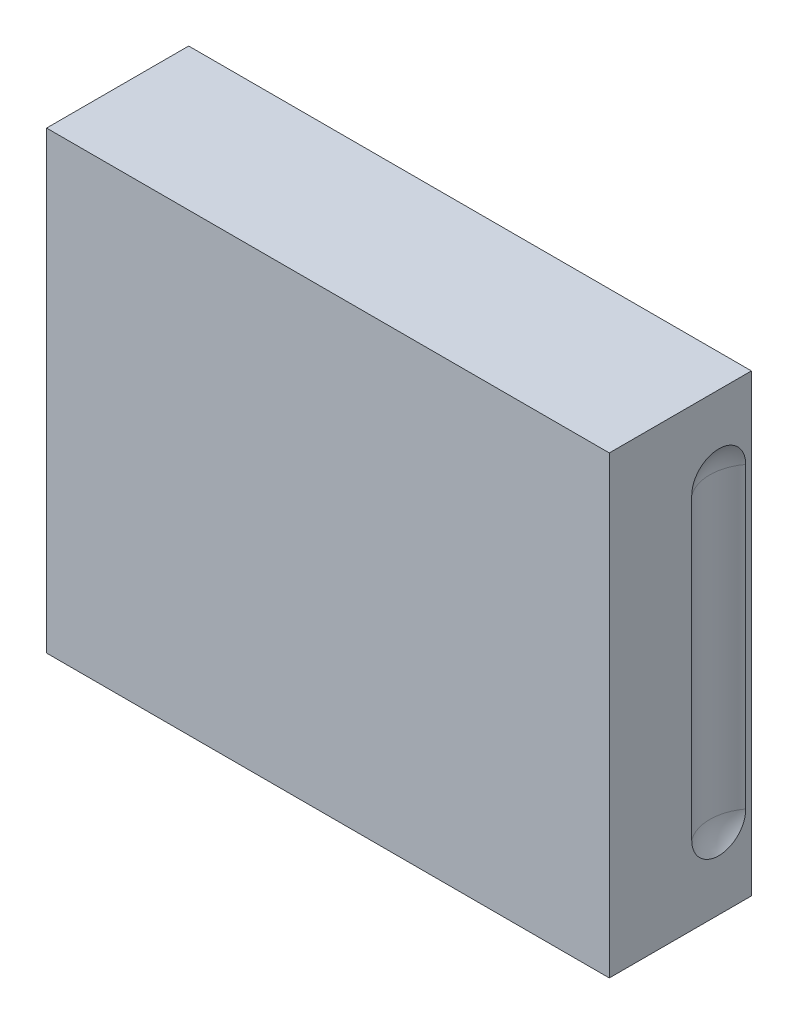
ISO-10303-21;
HEADER;
FILE_DESCRIPTION(('STEP AP214'),'2;1');
FILE_NAME('part.step','',(''),(''),'','','');
FILE_SCHEMA(('AUTOMOTIVE_DESIGN { 1 0 10303 214 1 1 1 1 }'));
ENDSEC;
DATA;
#1=APPLICATION_CONTEXT('core data for automotive mechanical design processes');
#2=APPLICATION_PROTOCOL_DEFINITION('international standard','automotive_design',2000,#1);
#3=PRODUCT_CONTEXT('',#1,'mechanical');
#4=PRODUCT('Part','Part','',(#3));
#5=PRODUCT_RELATED_PRODUCT_CATEGORY('part','',(#4));
#6=PRODUCT_DEFINITION_FORMATION('','',#4);
#7=PRODUCT_DEFINITION_CONTEXT('part definition',#1,'design');
#8=PRODUCT_DEFINITION('design','',#6,#7);
#9=PRODUCT_DEFINITION_SHAPE('','',#8);
#10=(LENGTH_UNIT() NAMED_UNIT(*) SI_UNIT(.MILLI.,.METRE.));
#11=(NAMED_UNIT(*) PLANE_ANGLE_UNIT() SI_UNIT($,.RADIAN.));
#12=(NAMED_UNIT(*) SI_UNIT($,.STERADIAN.) SOLID_ANGLE_UNIT());
#13=UNCERTAINTY_MEASURE_WITH_UNIT(LENGTH_MEASURE(1.E-05),#10,'distance_accuracy_value','');
#14=(GEOMETRIC_REPRESENTATION_CONTEXT(3) GLOBAL_UNCERTAINTY_ASSIGNED_CONTEXT((#13)) GLOBAL_UNIT_ASSIGNED_CONTEXT((#10,
#11,#12)) REPRESENTATION_CONTEXT('',''));
#15=CARTESIAN_POINT('',(0.,0.,0.));
#16=DIRECTION('',(0.,0.,1.));
#17=DIRECTION('',(1.,0.,0.));
#18=AXIS2_PLACEMENT_3D('',#15,#16,#17);
#19=CARTESIAN_POINT('',(-112.985411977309,221.299588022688,83.));
#20=DIRECTION('',(0.,0.,-1.));
#21=DIRECTION('',(-1.,0.,0.));
#22=AXIS2_PLACEMENT_3D('',#19,#20,#21);
#23=TOROIDAL_SURFACE('',#22,8.99999999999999,2.5);
#24=CARTESIAN_POINT('',(-101.500411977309,221.299588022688,83.2734501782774));
#25=CARTESIAN_POINT('',(-101.500411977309,221.246790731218,83.273455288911));
#26=CARTESIAN_POINT('',(-101.500411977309,221.193966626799,83.2701925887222));
#27=CARTESIAN_POINT('',(-101.500411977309,221.1155257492,83.2600004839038));
#28=CARTESIAN_POINT('',(-101.500411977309,221.089544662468,83.2557291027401));
#29=CARTESIAN_POINT('',(-101.500411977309,221.037960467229,83.2452152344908));
#30=CARTESIAN_POINT('',(-101.500411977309,221.01235748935,83.2389720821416));
#31=CARTESIAN_POINT('',(-101.500411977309,220.967249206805,83.2257832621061));
#32=CARTESIAN_POINT('',(-101.500411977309,220.947615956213,83.2192769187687));
#33=CARTESIAN_POINT('',(-101.500411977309,220.908988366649,83.2046080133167));
#34=CARTESIAN_POINT('',(-101.500411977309,220.889993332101,83.1964473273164));
#35=CARTESIAN_POINT('',(-101.500411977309,220.852778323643,83.1779977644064));
#36=CARTESIAN_POINT('',(-101.500411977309,220.834569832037,83.1676854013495));
#37=CARTESIAN_POINT('',(-101.500411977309,220.799917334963,83.1444367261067));
#38=CARTESIAN_POINT('',(-101.500411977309,220.783465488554,83.1315128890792));
#39=CARTESIAN_POINT('',(-101.500411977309,220.762009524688,83.1103383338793));
#40=CARTESIAN_POINT('',(-101.500411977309,220.755687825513,83.1034297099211));
#41=CARTESIAN_POINT('',(-101.500411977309,220.743956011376,83.0888561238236));
#42=CARTESIAN_POINT('',(-101.500411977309,220.738546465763,83.0811906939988));
#43=CARTESIAN_POINT('',(-101.500411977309,220.72891222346,83.0649921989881));
#44=CARTESIAN_POINT('',(-101.500411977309,220.724704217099,83.0564489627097));
#45=CARTESIAN_POINT('',(-101.500411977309,220.718000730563,83.038730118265));
#46=CARTESIAN_POINT('',(-101.500411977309,220.715498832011,83.0295570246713));
#47=CARTESIAN_POINT('',(-101.500411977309,220.712682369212,83.0118191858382));
#48=CARTESIAN_POINT('',(-101.500411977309,220.712173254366,83.0032859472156));
#49=CARTESIAN_POINT('',(-101.500411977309,220.712864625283,82.9862928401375));
#50=CARTESIAN_POINT('',(-101.500411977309,220.714065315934,82.9778329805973));
#51=CARTESIAN_POINT('',(-101.500411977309,220.719443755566,82.9554528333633));
#52=CARTESIAN_POINT('',(-101.500411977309,220.72512391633,82.9418895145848));
#53=CARTESIAN_POINT('',(-101.500411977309,220.738244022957,82.9189771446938));
#54=CARTESIAN_POINT('',(-101.500411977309,220.745174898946,82.9093104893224));
#55=CARTESIAN_POINT('',(-101.500411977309,220.760442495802,82.8911398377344));
#56=CARTESIAN_POINT('',(-101.500411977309,220.768782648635,82.882638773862));
#57=CARTESIAN_POINT('',(-101.500411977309,220.793090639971,82.860639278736));
#58=CARTESIAN_POINT('',(-101.500411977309,220.81004308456,82.8482454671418));
#59=CARTESIAN_POINT('',(-101.500411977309,220.845496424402,82.8259633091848));
#60=CARTESIAN_POINT('',(-101.500411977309,220.864000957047,82.8160810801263));
#61=CARTESIAN_POINT('',(-101.500411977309,220.902064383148,82.7982439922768));
#62=CARTESIAN_POINT('',(-101.500411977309,220.921629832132,82.790303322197));
#63=CARTESIAN_POINT('',(-101.500411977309,220.96135707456,82.7760830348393));
#64=CARTESIAN_POINT('',(-101.500411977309,220.981519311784,82.7698046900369));
#65=CARTESIAN_POINT('',(-101.500411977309,221.042678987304,82.7530655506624));
#66=CARTESIAN_POINT('',(-101.500411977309,221.084266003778,82.7447364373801));
#67=CARTESIAN_POINT('',(-101.500411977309,221.160393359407,82.7338085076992));
#68=CARTESIAN_POINT('',(-101.500411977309,221.194834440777,82.7304412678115));
#69=CARTESIAN_POINT('',(-101.500411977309,221.263909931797,82.7265736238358));
#70=CARTESIAN_POINT('',(-101.500411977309,221.298544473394,82.7260755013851));
#71=CARTESIAN_POINT('',(-101.500411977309,221.367699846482,82.7279146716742));
#72=CARTESIAN_POINT('',(-101.500411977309,221.402220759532,82.7302489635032));
#73=CARTESIAN_POINT('',(-101.500411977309,221.470911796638,82.7379061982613));
#74=CARTESIAN_POINT('',(-101.500411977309,221.505082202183,82.7432265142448));
#75=CARTESIAN_POINT('',(-101.500411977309,221.571545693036,82.7570160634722));
#76=CARTESIAN_POINT('',(-101.500411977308,221.603862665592,82.7653688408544));
#77=CARTESIAN_POINT('',(-101.50041197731,221.66721060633,82.7859159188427));
#78=CARTESIAN_POINT('',(-101.500411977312,221.698245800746,82.7980962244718));
#79=CARTESIAN_POINT('',(-101.50041197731,221.742251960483,82.8199636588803));
#80=CARTESIAN_POINT('',(-101.500411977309,221.756214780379,82.8276467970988));
#81=CARTESIAN_POINT('',(-101.500411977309,221.783230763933,82.8444560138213));
#82=CARTESIAN_POINT('',(-101.500411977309,221.796285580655,82.8535793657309));
#83=CARTESIAN_POINT('',(-101.500411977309,221.818726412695,82.8717689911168));
#84=CARTESIAN_POINT('',(-101.500411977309,221.828346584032,82.8805400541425));
#85=CARTESIAN_POINT('',(-101.500411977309,221.846135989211,82.8994148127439));
#86=CARTESIAN_POINT('',(-101.500411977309,221.854309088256,82.9095148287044));
#87=CARTESIAN_POINT('',(-101.500411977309,221.870465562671,82.9343470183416));
#88=CARTESIAN_POINT('',(-101.500411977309,221.877751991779,82.949583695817));
#89=CARTESIAN_POINT('',(-101.500411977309,221.884318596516,82.9737193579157));
#90=CARTESIAN_POINT('',(-101.500411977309,221.885775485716,82.9820332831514));
#91=CARTESIAN_POINT('',(-101.500411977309,221.887030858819,82.9987883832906));
#92=CARTESIAN_POINT('',(-101.500411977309,221.886830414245,83.0072294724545));
#93=CARTESIAN_POINT('',(-101.500411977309,221.884928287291,83.0228241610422));
#94=CARTESIAN_POINT('',(-101.500411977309,221.883423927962,83.030003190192));
#95=CARTESIAN_POINT('',(-101.500411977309,221.879313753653,83.0440462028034));
#96=CARTESIAN_POINT('',(-101.500411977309,221.876705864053,83.0509095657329));
#97=CARTESIAN_POINT('',(-101.500411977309,221.864854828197,83.076596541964));
#98=CARTESIAN_POINT('',(-101.500411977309,221.852299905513,83.0938883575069));
#99=CARTESIAN_POINT('',(-101.500411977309,221.825929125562,83.1221499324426));
#100=CARTESIAN_POINT('',(-101.500411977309,221.812649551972,83.1336903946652));
#101=CARTESIAN_POINT('',(-101.500411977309,221.784543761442,83.1547882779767));
#102=CARTESIAN_POINT('',(-101.500411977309,221.769713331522,83.1643400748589));
#103=CARTESIAN_POINT('',(-101.500411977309,221.739332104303,83.1816683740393));
#104=CARTESIAN_POINT('',(-101.500411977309,221.723793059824,83.1894661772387));
#105=CARTESIAN_POINT('',(-101.500411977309,221.692111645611,83.2037344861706));
#106=CARTESIAN_POINT('',(-101.500411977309,221.675968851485,83.2102040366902));
#107=CARTESIAN_POINT('',(-101.500411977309,221.626906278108,83.2279283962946));
#108=CARTESIAN_POINT('',(-101.500411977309,221.593375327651,83.2374868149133));
#109=CARTESIAN_POINT('',(-101.500411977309,221.516915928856,83.2550274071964));
#110=CARTESIAN_POINT('',(-101.500411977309,221.473763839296,83.2619925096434));
#111=CARTESIAN_POINT('',(-101.500411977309,221.386943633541,83.2712043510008));
#112=CARTESIAN_POINT('',(-101.500411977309,221.343275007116,83.2734459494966));
#113=CARTESIAN_POINT('',(-101.500411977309,221.299588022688,83.2734501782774));
#114=B_SPLINE_CURVE_WITH_KNOTS('',3,(#24,#25,#26,#27,#28,#29,#30,#31,#32,#33,#34,#35,#36,#37,
#38,#39,#40,#41,#42,#43,#44,#45,#46,#47,#48,#49,#50,#51,#52,#53,#54,#55,#56,#57,#58,#59,#60,#61,
#62,#63,#64,#65,#66,#67,#68,#69,#70,#71,#72,#73,#74,#75,#76,#77,#78,#79,#80,#81,#82,#83,#84,#85,
#86,#87,#88,#89,#90,#91,#92,#93,#94,#95,#96,#97,#98,#99,#100,#101,#102,#103,#104,#105,#106,#107,
#108,#109,#110,#111,#112,#113),.UNSPECIFIED.,.T.,.F.,(4,2,2,2,2,2,2,2,2,2,2,2,2,2,2,2,2,2,2,2,2,
2,2,2,2,2,2,2,2,2,2,2,2,2,2,2,2,2,2,2,2,2,2,2,4),(0.,0.15828049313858,0.237215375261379,
0.316176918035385,0.378168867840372,0.44009090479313,0.502727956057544,0.565072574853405,
0.593109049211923,0.621162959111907,0.649589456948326,0.677908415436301,0.703381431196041,
0.72885749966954,0.772301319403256,0.807831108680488,0.843448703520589,0.906101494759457,
0.968905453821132,1.03215550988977,1.0954538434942,1.22232014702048,1.32603071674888,
1.42982374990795,1.53350691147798,1.63709900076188,1.73707341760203,1.83668645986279,
1.88443333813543,1.9320908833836,1.97102529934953,2.00985409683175,2.05957979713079,
2.0847548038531,2.10991353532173,2.13182148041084,2.15377079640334,2.21659974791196,
2.26922071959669,2.3219885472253,2.37407604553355,2.42620087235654,2.53052777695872,
2.6613542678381,2.79232305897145),.UNSPECIFIED.);
#115=CARTESIAN_POINT('',(-101.500411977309,221.299588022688,83.2734501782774));
#116=VERTEX_POINT('',#115);
#117=EDGE_CURVE('E18',#116,#116,#114,.T.);
#118=ORIENTED_EDGE('',*,*,#117,.F.);
#119=EDGE_LOOP('',(#118));
#120=FACE_BOUND('',#119,.T.);
#121=ADVANCED_FACE('F14',(#120),#23,.F.);
#122=CARTESIAN_POINT('',(-112.985411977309,162.299588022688,83.));
#123=DIRECTION('',(0.,0.,-1.));
#124=DIRECTION('',(-1.,0.,0.));
#125=AXIS2_PLACEMENT_3D('',#122,#123,#124);
#126=TOROIDAL_SURFACE('',#125,8.99999999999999,2.5);
#127=CARTESIAN_POINT('',(-101.500411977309,162.299588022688,83.2734501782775));
#128=CARTESIAN_POINT('',(-101.500411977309,162.246790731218,83.2734552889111));
#129=CARTESIAN_POINT('',(-101.500411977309,162.193966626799,83.2701925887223));
#130=CARTESIAN_POINT('',(-101.500411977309,162.1155257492,83.2600004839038));
#131=CARTESIAN_POINT('',(-101.500411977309,162.089544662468,83.2557291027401));
#132=CARTESIAN_POINT('',(-101.500411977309,162.037960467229,83.2452152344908));
#133=CARTESIAN_POINT('',(-101.500411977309,162.01235748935,83.2389720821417));
#134=CARTESIAN_POINT('',(-101.500411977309,161.967249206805,83.2257832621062));
#135=CARTESIAN_POINT('',(-101.500411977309,161.947615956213,83.2192769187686));
#136=CARTESIAN_POINT('',(-101.500411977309,161.908988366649,83.2046080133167));
#137=CARTESIAN_POINT('',(-101.500411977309,161.889993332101,83.1964473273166));
#138=CARTESIAN_POINT('',(-101.500411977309,161.852778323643,83.1779977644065));
#139=CARTESIAN_POINT('',(-101.500411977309,161.834569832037,83.1676854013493));
#140=CARTESIAN_POINT('',(-101.500411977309,161.799917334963,83.1444367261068));
#141=CARTESIAN_POINT('',(-101.50041197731,161.783465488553,83.1315128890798));
#142=CARTESIAN_POINT('',(-101.500411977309,161.762009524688,83.1103383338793));
#143=CARTESIAN_POINT('',(-101.500411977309,161.755687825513,83.1034297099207));
#144=CARTESIAN_POINT('',(-101.500411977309,161.743956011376,83.0888561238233));
#145=CARTESIAN_POINT('',(-101.500411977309,161.738546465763,83.0811906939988));
#146=CARTESIAN_POINT('',(-101.500411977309,161.72891222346,83.0649921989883));
#147=CARTESIAN_POINT('',(-101.500411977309,161.724704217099,83.0564489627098));
#148=CARTESIAN_POINT('',(-101.500411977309,161.718000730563,83.038730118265));
#149=CARTESIAN_POINT('',(-101.500411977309,161.715498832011,83.0295570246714));
#150=CARTESIAN_POINT('',(-101.500411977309,161.712682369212,83.0118191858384));
#151=CARTESIAN_POINT('',(-101.500411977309,161.712173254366,83.0032859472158));
#152=CARTESIAN_POINT('',(-101.500411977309,161.712864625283,82.9862928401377));
#153=CARTESIAN_POINT('',(-101.500411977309,161.714065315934,82.9778329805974));
#154=CARTESIAN_POINT('',(-101.500411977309,161.719443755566,82.9554528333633));
#155=CARTESIAN_POINT('',(-101.500411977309,161.725123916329,82.9418895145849));
#156=CARTESIAN_POINT('',(-101.500411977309,161.738244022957,82.9189771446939));
#157=CARTESIAN_POINT('',(-101.500411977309,161.745174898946,82.9093104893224));
#158=CARTESIAN_POINT('',(-101.500411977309,161.760442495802,82.8911398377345));
#159=CARTESIAN_POINT('',(-101.500411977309,161.768782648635,82.8826387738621));
#160=CARTESIAN_POINT('',(-101.500411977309,161.793090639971,82.8606392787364));
#161=CARTESIAN_POINT('',(-101.500411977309,161.81004308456,82.8482454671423));
#162=CARTESIAN_POINT('',(-101.500411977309,161.845496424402,82.8259633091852));
#163=CARTESIAN_POINT('',(-101.500411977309,161.864000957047,82.8160810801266));
#164=CARTESIAN_POINT('',(-101.500411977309,161.902064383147,82.7982439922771));
#165=CARTESIAN_POINT('',(-101.500411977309,161.921629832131,82.7903033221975));
#166=CARTESIAN_POINT('',(-101.500411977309,161.961357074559,82.7760830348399));
#167=CARTESIAN_POINT('',(-101.500411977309,161.981519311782,82.7698046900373));
#168=CARTESIAN_POINT('',(-101.500411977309,162.042678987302,82.7530655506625));
#169=CARTESIAN_POINT('',(-101.500411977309,162.084266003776,82.7447364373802));
#170=CARTESIAN_POINT('',(-101.500411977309,162.160393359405,82.7338085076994));
#171=CARTESIAN_POINT('',(-101.500411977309,162.194834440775,82.7304412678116));
#172=CARTESIAN_POINT('',(-101.500411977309,162.263909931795,82.7265736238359));
#173=CARTESIAN_POINT('',(-101.500411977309,162.298544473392,82.7260755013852));
#174=CARTESIAN_POINT('',(-101.500411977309,162.36769984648,82.7279146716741));
#175=CARTESIAN_POINT('',(-101.500411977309,162.40222075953,82.730248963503));
#176=CARTESIAN_POINT('',(-101.500411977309,162.470911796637,82.7379061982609));
#177=CARTESIAN_POINT('',(-101.500411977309,162.505082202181,82.7432265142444));
#178=CARTESIAN_POINT('',(-101.500411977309,162.571545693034,82.7570160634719));
#179=CARTESIAN_POINT('',(-101.500411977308,162.60386266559,82.7653688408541));
#180=CARTESIAN_POINT('',(-101.50041197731,162.667210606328,82.7859159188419));
#181=CARTESIAN_POINT('',(-101.500411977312,162.698245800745,82.7980962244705));
#182=CARTESIAN_POINT('',(-101.50041197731,162.742251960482,82.8199636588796));
#183=CARTESIAN_POINT('',(-101.500411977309,162.756214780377,82.8276467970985));
#184=CARTESIAN_POINT('',(-101.500411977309,162.783230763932,82.844456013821));
#185=CARTESIAN_POINT('',(-101.500411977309,162.796285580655,82.85357936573));
#186=CARTESIAN_POINT('',(-101.500411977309,162.818726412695,82.8717689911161));
#187=CARTESIAN_POINT('',(-101.500411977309,162.828346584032,82.8805400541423));
#188=CARTESIAN_POINT('',(-101.500411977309,162.84613598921,82.8994148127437));
#189=CARTESIAN_POINT('',(-101.500411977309,162.854309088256,82.9095148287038));
#190=CARTESIAN_POINT('',(-101.500411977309,162.870465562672,82.9343470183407));
#191=CARTESIAN_POINT('',(-101.500411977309,162.87775199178,82.9495836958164));
#192=CARTESIAN_POINT('',(-101.500411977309,162.884318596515,82.9737193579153));
#193=CARTESIAN_POINT('',(-101.500411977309,162.885775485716,82.9820332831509));
#194=CARTESIAN_POINT('',(-101.500411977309,162.887030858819,82.9987883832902));
#195=CARTESIAN_POINT('',(-101.500411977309,162.886830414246,83.0072294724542));
#196=CARTESIAN_POINT('',(-101.500411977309,162.884928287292,83.0228241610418));
#197=CARTESIAN_POINT('',(-101.500411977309,162.883423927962,83.0300031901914));
#198=CARTESIAN_POINT('',(-101.500411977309,162.879313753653,83.0440462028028));
#199=CARTESIAN_POINT('',(-101.500411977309,162.876705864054,83.0509095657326));
#200=CARTESIAN_POINT('',(-101.500411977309,162.864854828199,83.0765965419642));
#201=CARTESIAN_POINT('',(-101.500411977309,162.852299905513,83.0938883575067));
#202=CARTESIAN_POINT('',(-101.500411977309,162.825929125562,83.1221499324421));
#203=CARTESIAN_POINT('',(-101.500411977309,162.812649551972,83.1336903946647));
#204=CARTESIAN_POINT('',(-101.500411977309,162.784543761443,83.1547882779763));
#205=CARTESIAN_POINT('',(-101.500411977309,162.769713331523,83.1643400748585));
#206=CARTESIAN_POINT('',(-101.500411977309,162.739332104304,83.1816683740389));
#207=CARTESIAN_POINT('',(-101.500411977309,162.723793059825,83.1894661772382));
#208=CARTESIAN_POINT('',(-101.500411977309,162.692111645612,83.20373448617));
#209=CARTESIAN_POINT('',(-101.500411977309,162.675968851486,83.2102040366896));
#210=CARTESIAN_POINT('',(-101.500411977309,162.626906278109,83.227928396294));
#211=CARTESIAN_POINT('',(-101.500411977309,162.593375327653,83.2374868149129));
#212=CARTESIAN_POINT('',(-101.500411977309,162.516915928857,83.2550274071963));
#213=CARTESIAN_POINT('',(-101.500411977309,162.473763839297,83.2619925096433));
#214=CARTESIAN_POINT('',(-101.500411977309,162.386943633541,83.2712043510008));
#215=CARTESIAN_POINT('',(-101.500411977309,162.343275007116,83.2734459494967));
#216=CARTESIAN_POINT('',(-101.500411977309,162.299588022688,83.2734501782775));
#217=B_SPLINE_CURVE_WITH_KNOTS('',3,(#127,#128,#129,#130,#131,#132,#133,#134,#135,#136,#137,
#138,#139,#140,#141,#142,#143,#144,#145,#146,#147,#148,#149,#150,#151,#152,#153,#154,#155,#156,
#157,#158,#159,#160,#161,#162,#163,#164,#165,#166,#167,#168,#169,#170,#171,#172,#173,#174,#175,
#176,#177,#178,#179,#180,#181,#182,#183,#184,#185,#186,#187,#188,#189,#190,#191,#192,#193,#194,
#195,#196,#197,#198,#199,#200,#201,#202,#203,#204,#205,#206,#207,#208,#209,#210,#211,#212,#213,
#214,#215,#216),.UNSPECIFIED.,.T.,.F.,(4,2,2,2,2,2,2,2,2,2,2,2,2,2,2,2,2,2,2,2,2,2,2,2,2,2,2,2,
2,2,2,2,2,2,2,2,2,2,2,2,2,2,2,2,4),(0.,0.158280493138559,0.237215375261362,0.316176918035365,
0.378168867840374,0.440090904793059,0.502727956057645,0.565072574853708,0.593109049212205,
0.621162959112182,0.649589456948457,0.677908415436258,0.703381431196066,0.728857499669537,
0.77230131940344,0.807831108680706,0.843448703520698,0.906101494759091,0.968905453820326,
1.03215550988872,1.0954538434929,1.22232014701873,1.3260307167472,1.42982374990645,
1.53350691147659,1.6370990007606,1.73707341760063,1.83668645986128,1.88443333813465,
1.93209088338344,1.97102529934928,2.00985409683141,2.05957979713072,2.08475480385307,
2.10991353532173,2.13182148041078,2.15377079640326,2.21659974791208,2.26922071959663,
2.32198854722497,2.37407604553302,2.42620087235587,2.53052777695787,2.66135426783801,
2.79232305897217),.UNSPECIFIED.);
#218=CARTESIAN_POINT('',(-101.500411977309,162.299588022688,83.2734501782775));
#219=VERTEX_POINT('',#218);
#220=EDGE_CURVE('E474',#219,#219,#217,.T.);
#221=ORIENTED_EDGE('',*,*,#220,.F.);
#222=EDGE_LOOP('',(#221));
#223=FACE_BOUND('',#222,.T.);
#224=ADVANCED_FACE('F438',(#223),#126,.F.);
#225=CARTESIAN_POINT('',(-136.015411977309,221.299588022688,83.));
#226=DIRECTION('',(0.,0.,-1.));
#227=DIRECTION('',(-1.,0.,0.));
#228=AXIS2_PLACEMENT_3D('',#225,#226,#227);
#229=TOROIDAL_SURFACE('',#228,9.00000000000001,2.5);
#230=CARTESIAN_POINT('',(-147.500411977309,221.299588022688,83.2734501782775));
#231=CARTESIAN_POINT('',(-147.500411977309,221.352385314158,83.2734552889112));
#232=CARTESIAN_POINT('',(-147.500411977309,221.405209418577,83.2701925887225));
#233=CARTESIAN_POINT('',(-147.500411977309,221.483650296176,83.2600004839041));
#234=CARTESIAN_POINT('',(-147.500411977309,221.509631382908,83.2557291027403));
#235=CARTESIAN_POINT('',(-147.500411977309,221.561215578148,83.2452152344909));
#236=CARTESIAN_POINT('',(-147.500411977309,221.586818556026,83.2389720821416));
#237=CARTESIAN_POINT('',(-147.500411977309,221.631926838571,83.2257832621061));
#238=CARTESIAN_POINT('',(-147.500411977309,221.651560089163,83.2192769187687));
#239=CARTESIAN_POINT('',(-147.500411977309,221.690187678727,83.2046080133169));
#240=CARTESIAN_POINT('',(-147.500411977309,221.709182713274,83.1964473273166));
#241=CARTESIAN_POINT('',(-147.500411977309,221.746397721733,83.1779977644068));
#242=CARTESIAN_POINT('',(-147.500411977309,221.764606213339,83.1676854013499));
#243=CARTESIAN_POINT('',(-147.500411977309,221.799258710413,83.1444367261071));
#244=CARTESIAN_POINT('',(-147.500411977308,221.815710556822,83.1315128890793));
#245=CARTESIAN_POINT('',(-147.500411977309,221.837166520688,83.1103383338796));
#246=CARTESIAN_POINT('',(-147.500411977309,221.843488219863,83.1034297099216));
#247=CARTESIAN_POINT('',(-147.500411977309,221.855220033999,83.088856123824));
#248=CARTESIAN_POINT('',(-147.500411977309,221.860629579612,83.081190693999));
#249=CARTESIAN_POINT('',(-147.500411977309,221.870263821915,83.0649921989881));
#250=CARTESIAN_POINT('',(-147.500411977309,221.874471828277,83.0564489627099));
#251=CARTESIAN_POINT('',(-147.500411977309,221.881175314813,83.0387301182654));
#252=CARTESIAN_POINT('',(-147.500411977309,221.883677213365,83.0295570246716));
#253=CARTESIAN_POINT('',(-147.500411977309,221.886493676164,83.0118191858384));
#254=CARTESIAN_POINT('',(-147.500411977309,221.88700279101,83.0032859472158));
#255=CARTESIAN_POINT('',(-147.500411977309,221.886311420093,82.9862928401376));
#256=CARTESIAN_POINT('',(-147.500411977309,221.885110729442,82.9778329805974));
#257=CARTESIAN_POINT('',(-147.500411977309,221.879732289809,82.9554528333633));
#258=CARTESIAN_POINT('',(-147.500411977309,221.874052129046,82.9418895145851));
#259=CARTESIAN_POINT('',(-147.500411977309,221.860932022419,82.9189771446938));
#260=CARTESIAN_POINT('',(-147.500411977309,221.85400114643,82.909310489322));
#261=CARTESIAN_POINT('',(-147.500411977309,221.838733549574,82.8911398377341));
#262=CARTESIAN_POINT('',(-147.500411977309,221.830393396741,82.882638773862));
#263=CARTESIAN_POINT('',(-147.500411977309,221.806085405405,82.8606392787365));
#264=CARTESIAN_POINT('',(-147.500411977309,221.789132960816,82.848245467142));
#265=CARTESIAN_POINT('',(-147.500411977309,221.753679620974,82.8259633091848));
#266=CARTESIAN_POINT('',(-147.500411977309,221.735175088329,82.8160810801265));
#267=CARTESIAN_POINT('',(-147.500411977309,221.697111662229,82.798243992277));
#268=CARTESIAN_POINT('',(-147.500411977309,221.677546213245,82.7903033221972));
#269=CARTESIAN_POINT('',(-147.500411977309,221.637818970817,82.7760830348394));
#270=CARTESIAN_POINT('',(-147.500411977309,221.617656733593,82.7698046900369));
#271=CARTESIAN_POINT('',(-147.500411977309,221.556497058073,82.7530655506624));
#272=CARTESIAN_POINT('',(-147.500411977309,221.514910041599,82.7447364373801));
#273=CARTESIAN_POINT('',(-147.500411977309,221.43878268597,82.7338085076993));
#274=CARTESIAN_POINT('',(-147.500411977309,221.404341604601,82.7304412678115));
#275=CARTESIAN_POINT('',(-147.500411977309,221.335266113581,82.7265736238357));
#276=CARTESIAN_POINT('',(-147.500411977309,221.300631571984,82.7260755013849));
#277=CARTESIAN_POINT('',(-147.500411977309,221.231476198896,82.7279146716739));
#278=CARTESIAN_POINT('',(-147.500411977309,221.196955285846,82.7302489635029));
#279=CARTESIAN_POINT('',(-147.500411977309,221.128264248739,82.7379061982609));
#280=CARTESIAN_POINT('',(-147.500411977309,221.094093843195,82.7432265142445));
#281=CARTESIAN_POINT('',(-147.500411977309,221.027630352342,82.7570160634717));
#282=CARTESIAN_POINT('',(-147.50041197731,220.995313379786,82.7653688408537));
#283=CARTESIAN_POINT('',(-147.500411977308,220.931965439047,82.7859159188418));
#284=CARTESIAN_POINT('',(-147.500411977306,220.900930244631,82.7980962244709));
#285=CARTESIAN_POINT('',(-147.500411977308,220.856924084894,82.8199636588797));
#286=CARTESIAN_POINT('',(-147.500411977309,220.842961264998,82.8276467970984));
#287=CARTESIAN_POINT('',(-147.500411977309,220.815945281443,82.8444560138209));
#288=CARTESIAN_POINT('',(-147.500411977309,220.802890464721,82.8535793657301));
#289=CARTESIAN_POINT('',(-147.500411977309,220.780449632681,82.8717689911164));
#290=CARTESIAN_POINT('',(-147.500411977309,220.770829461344,82.8805400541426));
#291=CARTESIAN_POINT('',(-147.500411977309,220.753040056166,82.899414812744));
#292=CARTESIAN_POINT('',(-147.500411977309,220.74486695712,82.9095148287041));
#293=CARTESIAN_POINT('',(-147.500411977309,220.728710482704,82.9343470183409));
#294=CARTESIAN_POINT('',(-147.500411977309,220.721424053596,82.9495836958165));
#295=CARTESIAN_POINT('',(-147.500411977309,220.71485744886,82.9737193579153));
#296=CARTESIAN_POINT('',(-147.500411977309,220.71340055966,82.9820332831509));
#297=CARTESIAN_POINT('',(-147.500411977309,220.712145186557,82.9987883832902));
#298=CARTESIAN_POINT('',(-147.500411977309,220.71234563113,83.0072294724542));
#299=CARTESIAN_POINT('',(-147.500411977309,220.714247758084,83.0228241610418));
#300=CARTESIAN_POINT('',(-147.500411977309,220.715752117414,83.0300031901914));
#301=CARTESIAN_POINT('',(-147.500411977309,220.719862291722,83.0440462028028));
#302=CARTESIAN_POINT('',(-147.500411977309,220.722470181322,83.0509095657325));
#303=CARTESIAN_POINT('',(-147.500411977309,220.734321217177,83.076596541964));
#304=CARTESIAN_POINT('',(-147.500411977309,220.746876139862,83.0938883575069));
#305=CARTESIAN_POINT('',(-147.500411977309,220.773246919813,83.1221499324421));
#306=CARTESIAN_POINT('',(-147.500411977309,220.786526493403,83.1336903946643));
#307=CARTESIAN_POINT('',(-147.500411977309,220.814632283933,83.1547882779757));
#308=CARTESIAN_POINT('',(-147.500411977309,220.829462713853,83.1643400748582));
#309=CARTESIAN_POINT('',(-147.500411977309,220.859843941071,83.1816683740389));
#310=CARTESIAN_POINT('',(-147.500411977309,220.87538298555,83.1894661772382));
#311=CARTESIAN_POINT('',(-147.500411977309,220.907064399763,83.20373448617));
#312=CARTESIAN_POINT('',(-147.500411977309,220.92320719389,83.2102040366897));
#313=CARTESIAN_POINT('',(-147.500411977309,220.972269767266,83.2279283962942));
#314=CARTESIAN_POINT('',(-147.500411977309,221.005800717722,83.2374868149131));
#315=CARTESIAN_POINT('',(-147.500411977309,221.082260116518,83.2550274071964));
#316=CARTESIAN_POINT('',(-147.500411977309,221.125412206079,83.2619925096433));
#317=CARTESIAN_POINT('',(-147.500411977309,221.212232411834,83.2712043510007));
#318=CARTESIAN_POINT('',(-147.500411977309,221.25590103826,83.2734459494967));
#319=CARTESIAN_POINT('',(-147.500411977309,221.299588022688,83.2734501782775));
#320=B_SPLINE_CURVE_WITH_KNOTS('',3,(#230,#231,#232,#233,#234,#235,#236,#237,#238,#239,#240,
#241,#242,#243,#244,#245,#246,#247,#248,#249,#250,#251,#252,#253,#254,#255,#256,#257,#258,#259,
#260,#261,#262,#263,#264,#265,#266,#267,#268,#269,#270,#271,#272,#273,#274,#275,#276,#277,#278,
#279,#280,#281,#282,#283,#284,#285,#286,#287,#288,#289,#290,#291,#292,#293,#294,#295,#296,#297,
#298,#299,#300,#301,#302,#303,#304,#305,#306,#307,#308,#309,#310,#311,#312,#313,#314,#315,#316,
#317,#318,#319),.UNSPECIFIED.,.T.,.F.,(4,2,2,2,2,2,2,2,2,2,2,2,2,2,2,2,2,2,2,2,2,2,2,2,2,2,2,2,
2,2,2,2,2,2,2,2,2,2,2,2,2,2,2,2,4),(0.,0.158280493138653,0.237215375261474,0.316176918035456,
0.378168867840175,0.440090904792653,0.502727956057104,0.565072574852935,0.593109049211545,
0.62116295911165,0.649589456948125,0.677908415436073,0.70338143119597,0.728857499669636,
0.772301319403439,0.80783110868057,0.843448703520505,0.906101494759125,0.968905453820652,
1.03215550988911,1.09545384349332,1.2223201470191,1.32603071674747,1.42982374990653,
1.53350691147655,1.63709900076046,1.73707341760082,1.83668645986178,1.88443333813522,
1.93209088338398,1.97102529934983,2.00985409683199,2.05957979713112,2.08475480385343,
2.10991353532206,2.13182148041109,2.1537707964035,2.21659974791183,2.26922071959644,
2.32198854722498,2.37407604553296,2.42620087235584,2.53052777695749,2.66135426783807,
2.79232305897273),.UNSPECIFIED.);
#321=CARTESIAN_POINT('',(-147.500411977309,221.299588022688,83.2734501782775));
#322=VERTEX_POINT('',#321);
#323=EDGE_CURVE('E269',#322,#322,#320,.T.);
#324=ORIENTED_EDGE('',*,*,#323,.F.);
#325=EDGE_LOOP('',(#324));
#326=FACE_BOUND('',#325,.T.);
#327=ADVANCED_FACE('F430',(#326),#229,.F.);
#328=CARTESIAN_POINT('',(-136.015411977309,162.299588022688,83.));
#329=DIRECTION('',(0.,0.,-1.));
#330=DIRECTION('',(-1.,0.,0.));
#331=AXIS2_PLACEMENT_3D('',#328,#329,#330);
#332=TOROIDAL_SURFACE('',#331,9.00000000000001,2.5);
#333=CARTESIAN_POINT('',(-147.500411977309,162.299588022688,83.2734501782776));
#334=CARTESIAN_POINT('',(-147.500411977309,162.352385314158,83.2734552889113));
#335=CARTESIAN_POINT('',(-147.500411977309,162.405209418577,83.2701925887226));
#336=CARTESIAN_POINT('',(-147.500411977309,162.483650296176,83.260000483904));
#337=CARTESIAN_POINT('',(-147.500411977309,162.509631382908,83.2557291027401));
#338=CARTESIAN_POINT('',(-147.500411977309,162.561215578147,83.2452152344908));
#339=CARTESIAN_POINT('',(-147.500411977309,162.586818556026,83.2389720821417));
#340=CARTESIAN_POINT('',(-147.500411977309,162.631926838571,83.2257832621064));
#341=CARTESIAN_POINT('',(-147.500411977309,162.651560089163,83.2192769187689));
#342=CARTESIAN_POINT('',(-147.500411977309,162.690187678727,83.2046080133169));
#343=CARTESIAN_POINT('',(-147.500411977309,162.709182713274,83.1964473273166));
#344=CARTESIAN_POINT('',(-147.500411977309,162.746397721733,83.1779977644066));
#345=CARTESIAN_POINT('',(-147.500411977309,162.764606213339,83.1676854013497));
#346=CARTESIAN_POINT('',(-147.500411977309,162.799258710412,83.1444367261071));
#347=CARTESIAN_POINT('',(-147.500411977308,162.815710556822,83.1315128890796));
#348=CARTESIAN_POINT('',(-147.500411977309,162.837166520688,83.1103383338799));
#349=CARTESIAN_POINT('',(-147.500411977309,162.843488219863,83.1034297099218));
#350=CARTESIAN_POINT('',(-147.500411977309,162.855220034,83.0888561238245));
#351=CARTESIAN_POINT('',(-147.500411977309,162.860629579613,83.0811906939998));
#352=CARTESIAN_POINT('',(-147.500411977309,162.870263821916,83.0649921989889));
#353=CARTESIAN_POINT('',(-147.500411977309,162.874471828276,83.0564489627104));
#354=CARTESIAN_POINT('',(-147.500411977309,162.881175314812,83.0387301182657));
#355=CARTESIAN_POINT('',(-147.500411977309,162.883677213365,83.0295570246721));
#356=CARTESIAN_POINT('',(-147.500411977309,162.886493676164,83.0118191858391));
#357=CARTESIAN_POINT('',(-147.500411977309,162.88700279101,83.0032859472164));
#358=CARTESIAN_POINT('',(-147.500411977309,162.886311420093,82.9862928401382));
#359=CARTESIAN_POINT('',(-147.500411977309,162.885110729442,82.977832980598));
#360=CARTESIAN_POINT('',(-147.500411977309,162.87973228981,82.9554528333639));
#361=CARTESIAN_POINT('',(-147.500411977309,162.874052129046,82.9418895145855));
#362=CARTESIAN_POINT('',(-147.500411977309,162.860932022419,82.9189771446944));
#363=CARTESIAN_POINT('',(-147.500411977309,162.85400114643,82.9093104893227));
#364=CARTESIAN_POINT('',(-147.500411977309,162.838733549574,82.8911398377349));
#365=CARTESIAN_POINT('',(-147.500411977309,162.830393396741,82.8826387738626));
#366=CARTESIAN_POINT('',(-147.500411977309,162.806085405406,82.8606392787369));
#367=CARTESIAN_POINT('',(-147.500411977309,162.789132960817,82.8482454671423));
#368=CARTESIAN_POINT('',(-147.500411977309,162.753679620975,82.8259633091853));
#369=CARTESIAN_POINT('',(-147.500411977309,162.73517508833,82.8160810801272));
#370=CARTESIAN_POINT('',(-147.500411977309,162.69711166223,82.7982439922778));
#371=CARTESIAN_POINT('',(-147.500411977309,162.677546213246,82.7903033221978));
#372=CARTESIAN_POINT('',(-147.500411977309,162.637818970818,82.7760830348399));
#373=CARTESIAN_POINT('',(-147.500411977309,162.617656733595,82.7698046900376));
#374=CARTESIAN_POINT('',(-147.500411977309,162.556497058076,82.7530655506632));
#375=CARTESIAN_POINT('',(-147.500411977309,162.514910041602,82.7447364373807));
#376=CARTESIAN_POINT('',(-147.500411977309,162.438782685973,82.7338085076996));
#377=CARTESIAN_POINT('',(-147.500411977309,162.404341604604,82.7304412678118));
#378=CARTESIAN_POINT('',(-147.500411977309,162.335266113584,82.7265736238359));
#379=CARTESIAN_POINT('',(-147.500411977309,162.300631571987,82.726075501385));
#380=CARTESIAN_POINT('',(-147.500411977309,162.231476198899,82.7279146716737));
#381=CARTESIAN_POINT('',(-147.500411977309,162.196955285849,82.7302489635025));
#382=CARTESIAN_POINT('',(-147.500411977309,162.128264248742,82.7379061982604));
#383=CARTESIAN_POINT('',(-147.500411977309,162.094093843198,82.743226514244));
#384=CARTESIAN_POINT('',(-147.500411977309,162.027630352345,82.7570160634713));
#385=CARTESIAN_POINT('',(-147.50041197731,161.995313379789,82.7653688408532));
#386=CARTESIAN_POINT('',(-147.500411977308,161.93196543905,82.7859159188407));
#387=CARTESIAN_POINT('',(-147.500411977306,161.900930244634,82.7980962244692));
#388=CARTESIAN_POINT('',(-147.500411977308,161.856924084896,82.8199636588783));
#389=CARTESIAN_POINT('',(-147.500411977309,161.842961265,82.8276467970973));
#390=CARTESIAN_POINT('',(-147.500411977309,161.815945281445,82.84445601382));
#391=CARTESIAN_POINT('',(-147.500411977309,161.802890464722,82.8535793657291));
#392=CARTESIAN_POINT('',(-147.500411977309,161.780449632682,82.8717689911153));
#393=CARTESIAN_POINT('',(-147.500411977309,161.770829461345,82.8805400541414));
#394=CARTESIAN_POINT('',(-147.500411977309,161.753040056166,82.8994148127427));
#395=CARTESIAN_POINT('',(-147.500411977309,161.74486695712,82.9095148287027));
#396=CARTESIAN_POINT('',(-147.500411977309,161.728710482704,82.9343470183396));
#397=CARTESIAN_POINT('',(-147.500411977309,161.721424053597,82.9495836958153));
#398=CARTESIAN_POINT('',(-147.500411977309,161.71485744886,82.9737193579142));
#399=CARTESIAN_POINT('',(-147.500411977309,161.71340055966,82.9820332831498));
#400=CARTESIAN_POINT('',(-147.500411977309,161.712145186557,82.9987883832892));
#401=CARTESIAN_POINT('',(-147.500411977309,161.712345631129,83.0072294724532));
#402=CARTESIAN_POINT('',(-147.500411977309,161.714247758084,83.0228241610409));
#403=CARTESIAN_POINT('',(-147.500411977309,161.715752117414,83.0300031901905));
#404=CARTESIAN_POINT('',(-147.500411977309,161.719862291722,83.044046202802));
#405=CARTESIAN_POINT('',(-147.500411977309,161.722470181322,83.0509095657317));
#406=CARTESIAN_POINT('',(-147.500411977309,161.734321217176,83.0765965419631));
#407=CARTESIAN_POINT('',(-147.500411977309,161.746876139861,83.0938883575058));
#408=CARTESIAN_POINT('',(-147.500411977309,161.773246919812,83.1221499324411));
#409=CARTESIAN_POINT('',(-147.500411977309,161.786526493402,83.1336903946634));
#410=CARTESIAN_POINT('',(-147.500411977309,161.814632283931,83.1547882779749));
#411=CARTESIAN_POINT('',(-147.500411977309,161.829462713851,83.1643400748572));
#412=CARTESIAN_POINT('',(-147.500411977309,161.859843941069,83.1816683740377));
#413=CARTESIAN_POINT('',(-147.500411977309,161.875382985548,83.189466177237));
#414=CARTESIAN_POINT('',(-147.500411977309,161.90706439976,83.2037344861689));
#415=CARTESIAN_POINT('',(-147.500411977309,161.923207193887,83.2102040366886));
#416=CARTESIAN_POINT('',(-147.500411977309,161.972269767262,83.2279283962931));
#417=CARTESIAN_POINT('',(-147.500411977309,162.005800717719,83.2374868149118));
#418=CARTESIAN_POINT('',(-147.500411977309,162.082260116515,83.2550274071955));
#419=CARTESIAN_POINT('',(-147.500411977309,162.125412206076,83.261992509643));
#420=CARTESIAN_POINT('',(-147.500411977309,162.212232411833,83.2712043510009));
#421=CARTESIAN_POINT('',(-147.500411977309,162.255901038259,83.2734459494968));
#422=CARTESIAN_POINT('',(-147.500411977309,162.299588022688,83.2734501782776));
#423=B_SPLINE_CURVE_WITH_KNOTS('',3,(#333,#334,#335,#336,#337,#338,#339,#340,#341,#342,#343,
#344,#345,#346,#347,#348,#349,#350,#351,#352,#353,#354,#355,#356,#357,#358,#359,#360,#361,#362,
#363,#364,#365,#366,#367,#368,#369,#370,#371,#372,#373,#374,#375,#376,#377,#378,#379,#380,#381,
#382,#383,#384,#385,#386,#387,#388,#389,#390,#391,#392,#393,#394,#395,#396,#397,#398,#399,#400,
#401,#402,#403,#404,#405,#406,#407,#408,#409,#410,#411,#412,#413,#414,#415,#416,#417,#418,#419,
#420,#421,#422),.UNSPECIFIED.,.T.,.F.,(4,2,2,2,2,2,2,2,2,2,2,2,2,2,2,2,2,2,2,2,2,2,2,2,2,2,2,2,
2,2,2,2,2,2,2,2,2,2,2,2,2,2,2,2,4),(0.,0.158280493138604,0.237215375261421,0.316176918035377,
0.378168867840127,0.440090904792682,0.502727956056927,0.565072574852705,0.593109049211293,
0.621162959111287,0.649589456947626,0.677908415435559,0.703381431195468,0.728857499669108,
0.772301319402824,0.807831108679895,0.843448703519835,0.906101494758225,0.968905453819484,
1.03215550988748,1.0954538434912,1.22232014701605,1.32603071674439,1.42982374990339,
1.53350691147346,1.63709900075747,1.73707341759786,1.83668645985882,1.88443333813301,
1.93209088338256,1.9710252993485,2.00985409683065,2.05957979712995,2.08475480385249,
2.10991353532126,2.13182148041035,2.15377079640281,2.21659974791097,2.26922071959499,
2.32198854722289,2.37407604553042,2.42620087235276,2.53052777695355,2.66135426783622,
2.79232305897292),.UNSPECIFIED.);
#424=CARTESIAN_POINT('',(-147.500411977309,162.299588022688,83.2734501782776));
#425=VERTEX_POINT('',#424);
#426=EDGE_CURVE('E272',#425,#425,#423,.T.);
#427=ORIENTED_EDGE('',*,*,#426,.F.);
#428=EDGE_LOOP('',(#427));
#429=FACE_BOUND('',#428,.T.);
#430=ADVANCED_FACE('F323',(#429),#332,.F.);
#431=CARTESIAN_POINT('',(-124.500411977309,191.799588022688,85.5));
#432=DIRECTION('',(0.,0.,-1.));
#433=DIRECTION('',(-1.,0.,0.));
#434=AXIS2_PLACEMENT_3D('',#431,#432,#433);
#435=PLANE('',#434);
#436=DIRECTION('',(0.,1.,0.));
#437=VECTOR('',#436,1.);
#438=CARTESIAN_POINT('',(-147.500411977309,191.799588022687,85.5));
#439=LINE('',#438,#437);
#440=CARTESIAN_POINT('',(-147.500411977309,238.799588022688,85.5));
#441=VERTEX_POINT('',#440);
#442=CARTESIAN_POINT('',(-147.500411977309,144.799588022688,85.5));
#443=VERTEX_POINT('',#442);
#444=EDGE_CURVE('E281',#441,#443,#439,.F.);
#445=ORIENTED_EDGE('',*,*,#444,.F.);
#446=DIRECTION('',(1.,0.,0.));
#447=VECTOR('',#446,1.);
#448=CARTESIAN_POINT('',(-124.500411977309,238.799588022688,85.5));
#449=LINE('',#448,#447);
#450=CARTESIAN_POINT('',(-101.500411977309,238.799588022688,85.5));
#451=VERTEX_POINT('',#450);
#452=EDGE_CURVE('E285',#451,#441,#449,.F.);
#453=ORIENTED_EDGE('',*,*,#452,.F.);
#454=DIRECTION('',(0.,1.,0.));
#455=VECTOR('',#454,1.);
#456=CARTESIAN_POINT('',(-101.500411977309,191.799588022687,85.5));
#457=LINE('',#456,#455);
#458=CARTESIAN_POINT('',(-101.500411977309,144.799588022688,85.5));
#459=VERTEX_POINT('',#458);
#460=EDGE_CURVE('E274',#459,#451,#457,.T.);
#461=ORIENTED_EDGE('',*,*,#460,.F.);
#462=DIRECTION('',(1.,0.,0.));
#463=VECTOR('',#462,1.);
#464=CARTESIAN_POINT('',(-124.500411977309,144.799588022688,85.5));
#465=LINE('',#464,#463);
#466=EDGE_CURVE('E268',#443,#459,#465,.T.);
#467=ORIENTED_EDGE('',*,*,#466,.F.);
#468=EDGE_LOOP('',(#445,#453,#461,#467));
#469=FACE_BOUND('',#468,.T.);
#470=ADVANCED_FACE('F293',(#469),#435,.T.);
#471=CARTESIAN_POINT('',(-101.500411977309,191.799588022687,77.5));
#472=DIRECTION('',(-1.,0.,0.));
#473=DIRECTION('',(0.,0.,1.));
#474=AXIS2_PLACEMENT_3D('',#471,#472,#473);
#475=PLANE('',#474);
#476=DIRECTION('',(0.,0.,-1.));
#477=VECTOR('',#476,1.);
#478=CARTESIAN_POINT('',(-101.500411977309,238.799588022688,69.6));
#479=LINE('',#478,#477);
#480=CARTESIAN_POINT('',(-101.500411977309,238.799588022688,69.5));
#481=VERTEX_POINT('',#480);
#482=EDGE_CURVE('E248',#481,#451,#479,.F.);
#483=ORIENTED_EDGE('',*,*,#482,.F.);
#484=DIRECTION('',(0.,-1.,0.));
#485=VECTOR('',#484,1.);
#486=CARTESIAN_POINT('',(-101.500411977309,191.799588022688,69.5));
#487=LINE('',#486,#485);
#488=CARTESIAN_POINT('',(-101.500411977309,144.799588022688,69.5));
#489=VERTEX_POINT('',#488);
#490=EDGE_CURVE('E226',#481,#489,#487,.T.);
#491=ORIENTED_EDGE('',*,*,#490,.T.);
#492=DIRECTION('',(0.,0.,1.));
#493=VECTOR('',#492,1.);
#494=CARTESIAN_POINT('',(-101.500411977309,144.799588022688,69.6));
#495=LINE('',#494,#493);
#496=EDGE_CURVE('E260',#459,#489,#495,.F.);
#497=ORIENTED_EDGE('',*,*,#496,.F.);
#498=ORIENTED_EDGE('',*,*,#460,.T.);
#499=EDGE_LOOP('',(#483,#491,#497,#498));
#500=FACE_BOUND('',#499,.T.);
#501=ORIENTED_EDGE('',*,*,#220,.T.);
#502=EDGE_LOOP('',(#501));
#503=FACE_BOUND('',#502,.T.);
#504=ORIENTED_EDGE('',*,*,#117,.T.);
#505=EDGE_LOOP('',(#504));
#506=FACE_BOUND('',#505,.T.);
#507=ADVANCED_FACE('F256',(#500,#503,#506),#475,.T.);
#508=CARTESIAN_POINT('',(-124.500411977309,144.799588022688,69.6));
#509=DIRECTION('',(0.,1.,0.));
#510=DIRECTION('',(0.,0.,1.));
#511=AXIS2_PLACEMENT_3D('',#508,#509,#510);
#512=PLANE('',#511);
#513=ORIENTED_EDGE('',*,*,#466,.T.);
#514=ORIENTED_EDGE('',*,*,#496,.T.);
#515=DIRECTION('',(1.,0.,0.));
#516=VECTOR('',#515,1.);
#517=CARTESIAN_POINT('',(-124.500411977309,144.799588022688,69.5));
#518=LINE('',#517,#516);
#519=CARTESIAN_POINT('',(-147.500411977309,144.799588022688,69.5));
#520=VERTEX_POINT('',#519);
#521=EDGE_CURVE('E229',#489,#520,#518,.F.);
#522=ORIENTED_EDGE('',*,*,#521,.T.);
#523=DIRECTION('',(0.,0.,-1.));
#524=VECTOR('',#523,1.);
#525=CARTESIAN_POINT('',(-147.500411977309,144.799588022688,77.5));
#526=LINE('',#525,#524);
#527=EDGE_CURVE('E279',#443,#520,#526,.T.);
#528=ORIENTED_EDGE('',*,*,#527,.F.);
#529=EDGE_LOOP('',(#513,#514,#522,#528));
#530=FACE_BOUND('',#529,.T.);
#531=ADVANCED_FACE('F265',(#530),#512,.T.);
#532=CARTESIAN_POINT('',(-147.500411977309,191.799588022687,77.5));
#533=DIRECTION('',(1.,0.,0.));
#534=DIRECTION('',(0.,0.,-1.));
#535=AXIS2_PLACEMENT_3D('',#532,#533,#534);
#536=PLANE('',#535);
#537=ORIENTED_EDGE('',*,*,#527,.T.);
#538=DIRECTION('',(0.,-1.,0.));
#539=VECTOR('',#538,1.);
#540=CARTESIAN_POINT('',(-147.500411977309,191.799588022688,69.5));
#541=LINE('',#540,#539);
#542=CARTESIAN_POINT('',(-147.500411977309,238.799588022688,69.5));
#543=VERTEX_POINT('',#542);
#544=EDGE_CURVE('E231',#520,#543,#541,.F.);
#545=ORIENTED_EDGE('',*,*,#544,.T.);
#546=DIRECTION('',(0.,0.,-1.));
#547=VECTOR('',#546,1.);
#548=CARTESIAN_POINT('',(-147.500411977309,238.799588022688,69.6));
#549=LINE('',#548,#547);
#550=EDGE_CURVE('E86',#441,#543,#549,.T.);
#551=ORIENTED_EDGE('',*,*,#550,.F.);
#552=ORIENTED_EDGE('',*,*,#444,.T.);
#553=EDGE_LOOP('',(#537,#545,#551,#552));
#554=FACE_BOUND('',#553,.T.);
#555=ORIENTED_EDGE('',*,*,#426,.T.);
#556=EDGE_LOOP('',(#555));
#557=FACE_BOUND('',#556,.T.);
#558=ORIENTED_EDGE('',*,*,#323,.T.);
#559=EDGE_LOOP('',(#558));
#560=FACE_BOUND('',#559,.T.);
#561=ADVANCED_FACE('F326',(#554,#557,#560),#536,.T.);
#562=CARTESIAN_POINT('',(-124.500411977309,238.799588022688,69.6));
#563=DIRECTION('',(0.,-1.,0.));
#564=DIRECTION('',(0.,0.,-1.));
#565=AXIS2_PLACEMENT_3D('',#562,#563,#564);
#566=PLANE('',#565);
#567=ORIENTED_EDGE('',*,*,#452,.T.);
#568=ORIENTED_EDGE('',*,*,#550,.T.);
#569=DIRECTION('',(1.,0.,0.));
#570=VECTOR('',#569,1.);
#571=CARTESIAN_POINT('',(-124.500411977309,238.799588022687,69.5));
#572=LINE('',#571,#570);
#573=EDGE_CURVE('E168',#543,#481,#572,.T.);
#574=ORIENTED_EDGE('',*,*,#573,.T.);
#575=ORIENTED_EDGE('',*,*,#482,.T.);
#576=EDGE_LOOP('',(#567,#568,#574,#575));
#577=FACE_BOUND('',#576,.T.);
#578=ADVANCED_FACE('F245',(#577),#566,.T.);
#579=CARTESIAN_POINT('',(-12.750411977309,139.299456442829,81.));
#580=DIRECTION('',(0.638713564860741,0.566919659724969,0.520237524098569));
#581=DIRECTION('',(-0.648673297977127,0.760384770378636,-0.0322172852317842));
#582=AXIS2_PLACEMENT_3D('',#579,#580,#581);
#583=SPHERICAL_SURFACE('',#582,15.9);
#584=CARTESIAN_POINT('',(-12.750411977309,139.299456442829,81.));
#585=DIRECTION('',(0.,1.,0.));
#586=DIRECTION('',(0.,0.,1.));
#587=AXIS2_PLACEMENT_3D('',#584,#585,#586);
#588=CIRCLE('',#587,15.9);
#589=CARTESIAN_POINT('',(-25.5004119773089,139.299456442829,71.5001315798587));
#590=VERTEX_POINT('',#589);
#591=CARTESIAN_POINT('',(-25.5004119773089,139.299456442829,90.4998684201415));
#592=VERTEX_POINT('',#591);
#593=EDGE_CURVE('E80',#590,#592,#588,.T.);
#594=ORIENTED_EDGE('',*,*,#593,.T.);
#595=CARTESIAN_POINT('',(-25.5004119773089,139.299456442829,90.4998684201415));
#596=CARTESIAN_POINT('',(-25.5004119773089,139.032269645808,90.4998971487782));
#597=CARTESIAN_POINT('',(-25.5004119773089,138.765086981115,90.4885975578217));
#598=CARTESIAN_POINT('',(-25.5004119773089,138.232633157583,90.4435492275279));
#599=CARTESIAN_POINT('',(-25.5004119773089,137.967361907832,90.4098015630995));
#600=CARTESIAN_POINT('',(-25.5004119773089,137.440793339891,90.3200960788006));
#601=CARTESIAN_POINT('',(-25.5004119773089,137.179493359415,90.2641538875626));
#602=CARTESIAN_POINT('',(-25.5004119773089,136.662535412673,90.1304663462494));
#603=CARTESIAN_POINT('',(-25.5004119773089,136.406877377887,90.052721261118));
#604=CARTESIAN_POINT('',(-25.5004119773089,135.902900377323,89.8759367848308));
#605=CARTESIAN_POINT('',(-25.5004119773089,135.654584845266,89.7768876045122));
#606=CARTESIAN_POINT('',(-25.5004119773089,135.167176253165,89.5582186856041));
#607=CARTESIAN_POINT('',(-25.5004119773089,134.92808339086,89.4385985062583));
#608=CARTESIAN_POINT('',(-25.5004119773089,134.460873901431,89.1796660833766));
#609=CARTESIAN_POINT('',(-25.5004119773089,134.232755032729,89.0403578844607));
#610=CARTESIAN_POINT('',(-25.5004119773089,133.789063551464,88.7430218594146));
#611=CARTESIAN_POINT('',(-25.5004119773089,133.573490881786,88.584994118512));
#612=CARTESIAN_POINT('',(-25.5004119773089,133.156415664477,88.2513359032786));
#613=CARTESIAN_POINT('',(-25.5004119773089,132.954913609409,88.0757048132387));
#614=CARTESIAN_POINT('',(-25.5004119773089,132.567424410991,87.708096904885));
#615=CARTESIAN_POINT('',(-25.500411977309,132.381436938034,87.516120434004));
#616=CARTESIAN_POINT('',(-25.500411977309,132.026265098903,87.1171505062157));
#617=CARTESIAN_POINT('',(-25.500411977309,131.857083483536,86.9101546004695));
#618=CARTESIAN_POINT('',(-25.500411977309,131.536760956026,86.4826454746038));
#619=CARTESIAN_POINT('',(-25.5004119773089,131.385620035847,86.2621322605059));
#620=CARTESIAN_POINT('',(-25.5004119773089,131.102459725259,85.8091663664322));
#621=CARTESIAN_POINT('',(-25.500411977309,130.970439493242,85.5767142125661));
#622=CARTESIAN_POINT('',(-25.500411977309,130.7264512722,85.1015141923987));
#623=CARTESIAN_POINT('',(-25.500411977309,130.614483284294,84.8587663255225));
#624=CARTESIAN_POINT('',(-25.500411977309,130.41140215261,84.3647166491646));
#625=CARTESIAN_POINT('',(-25.500411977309,130.320287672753,84.1134153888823));
#626=CARTESIAN_POINT('',(-25.500411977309,130.159552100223,83.6040306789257));
#627=CARTESIAN_POINT('',(-25.5004119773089,130.089931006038,83.3459472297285));
#628=CARTESIAN_POINT('',(-25.5004119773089,129.972675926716,82.8248274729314));
#629=CARTESIAN_POINT('',(-25.500411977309,129.925042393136,82.5617910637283));
#630=CARTESIAN_POINT('',(-25.500411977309,129.852103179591,82.0326405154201));
#631=CARTESIAN_POINT('',(-25.500411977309,129.826797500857,81.7665263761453));
#632=CARTESIAN_POINT('',(-25.500411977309,129.798693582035,81.2331061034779));
#633=CARTESIAN_POINT('',(-25.500411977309,129.795895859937,80.9657999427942));
#634=CARTESIAN_POINT('',(-25.500411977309,129.812829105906,80.4319021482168));
#635=CARTESIAN_POINT('',(-25.5004119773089,129.832560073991,80.1653105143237));
#636=CARTESIAN_POINT('',(-25.5004119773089,129.894410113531,79.634739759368));
#637=CARTESIAN_POINT('',(-25.500411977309,129.936528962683,79.3707606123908));
#638=CARTESIAN_POINT('',(-25.500411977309,130.042855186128,78.847288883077));
#639=CARTESIAN_POINT('',(-25.500411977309,130.10706256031,78.5877963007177));
#640=CARTESIAN_POINT('',(-25.500411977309,130.257109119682,78.0751433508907));
#641=CARTESIAN_POINT('',(-25.500411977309,130.342948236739,77.8219829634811));
#642=CARTESIAN_POINT('',(-25.500411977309,130.535648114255,77.323793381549));
#643=CARTESIAN_POINT('',(-25.5004119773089,130.642508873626,77.0787641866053));
#644=CARTESIAN_POINT('',(-25.5004119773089,130.876494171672,76.5985751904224));
#645=CARTESIAN_POINT('',(-25.500411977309,131.003619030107,76.3634155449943));
#646=CARTESIAN_POINT('',(-25.500411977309,131.277230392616,75.9046368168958));
#647=CARTESIAN_POINT('',(-25.500411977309,131.423717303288,75.6810179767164));
#648=CARTESIAN_POINT('',(-25.500411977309,131.735000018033,75.246928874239));
#649=CARTESIAN_POINT('',(-25.500411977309,131.89979474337,75.0364578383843));
#650=CARTESIAN_POINT('',(-25.500411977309,132.24652825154,74.6301466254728));
#651=CARTESIAN_POINT('',(-25.5004119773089,132.428467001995,74.434306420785));
#652=CARTESIAN_POINT('',(-25.5004119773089,132.80816999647,74.0586738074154));
#653=CARTESIAN_POINT('',(-25.500411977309,133.005932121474,73.8788792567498));
#654=CARTESIAN_POINT('',(-25.500411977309,133.415897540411,73.5365863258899));
#655=CARTESIAN_POINT('',(-25.500411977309,133.628100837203,73.3740879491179));
#656=CARTESIAN_POINT('',(-25.500411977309,134.065513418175,73.067491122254));
#657=CARTESIAN_POINT('',(-25.500411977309,134.290727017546,72.9233988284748));
#658=CARTESIAN_POINT('',(-25.500411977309,134.752487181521,72.6547065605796));
#659=CARTESIAN_POINT('',(-25.5004119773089,134.989033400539,72.5301059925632));
#660=CARTESIAN_POINT('',(-25.5004119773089,135.471936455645,72.3012049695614));
#661=CARTESIAN_POINT('',(-25.500411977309,135.718299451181,72.1969175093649));
#662=CARTESIAN_POINT('',(-25.500411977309,136.218935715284,72.0094867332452));
#663=CARTESIAN_POINT('',(-25.500411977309,136.473208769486,71.9263428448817));
#664=CARTESIAN_POINT('',(-25.500411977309,136.987523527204,71.7818803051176));
#665=CARTESIAN_POINT('',(-25.500411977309,137.247557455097,71.7205339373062));
#666=CARTESIAN_POINT('',(-25.500411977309,137.771764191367,71.6199771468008));
#667=CARTESIAN_POINT('',(-25.5004119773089,138.035934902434,71.5807558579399));
#668=CARTESIAN_POINT('',(-25.5004119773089,138.467143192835,71.5351913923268));
#669=CARTESIAN_POINT('',(-25.500411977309,138.633490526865,71.5220355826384));
#670=CARTESIAN_POINT('',(-25.500411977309,138.96637161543,71.5045119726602));
#671=CARTESIAN_POINT('',(-25.500411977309,139.132904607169,71.5001296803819));
#672=CARTESIAN_POINT('',(-25.5004119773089,139.299456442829,71.5001315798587));
#673=B_SPLINE_CURVE_WITH_KNOTS('',3,(#595,#596,#597,#598,#599,#600,#601,#602,#603,#604,#605,
#606,#607,#608,#609,#610,#611,#612,#613,#614,#615,#616,#617,#618,#619,#620,#621,#622,#623,#624,
#625,#626,#627,#628,#629,#630,#631,#632,#633,#634,#635,#636,#637,#638,#639,#640,#641,#642,#643,
#644,#645,#646,#647,#648,#649,#650,#651,#652,#653,#654,#655,#656,#657,#658,#659,#660,#661,#662,
#663,#664,#665,#666,#667,#668,#669,#670,#671,#672),.UNSPECIFIED.,.F.,.F.,(4,2,2,2,2,2,2,2,2,2,2,
2,2,2,2,2,2,2,2,2,2,2,2,2,2,2,2,2,2,2,2,2,2,2,2,2,2,2,4),(0.,0.801315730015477,1.60259309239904,
2.40330722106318,3.20401162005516,4.00508472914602,4.80617500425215,5.60710094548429,
6.40802324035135,7.20897355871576,8.00990685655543,8.81097103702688,9.6120348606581,
10.4130634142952,11.214092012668,12.0150692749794,12.8160464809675,13.61704013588,
14.418033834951,15.2190459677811,16.0200581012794,16.8210622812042,17.6220664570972,
18.4230681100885,19.2240697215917,20.0250839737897,20.8261150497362,21.6270989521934,
22.4280813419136,23.2289566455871,24.0298321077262,24.8309747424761,25.6320929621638,
26.4337220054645,27.2353293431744,28.0359137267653,28.8361045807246,29.3364921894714,
29.8360525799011),.UNSPECIFIED.);
#674=EDGE_CURVE('E78',#592,#590,#673,.T.);
#675=ORIENTED_EDGE('',*,*,#674,.T.);
#676=EDGE_LOOP('',(#594,#675));
#677=FACE_BOUND('',#676,.T.);
#678=ADVANCED_FACE('F82',(#677),#583,.F.);
#679=CARTESIAN_POINT('',(-12.750411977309,172.964380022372,81.));
#680=DIRECTION('',(0.,1.,0.));
#681=DIRECTION('',(0.,0.,1.));
#682=AXIS2_PLACEMENT_3D('',#679,#680,#681);
#683=CYLINDRICAL_SURFACE('',#682,15.9);
#684=CARTESIAN_POINT('',(-12.750411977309,244.299719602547,81.));
#685=DIRECTION('',(0.,1.,0.));
#686=DIRECTION('',(0.,0.,1.));
#687=AXIS2_PLACEMENT_3D('',#684,#685,#686);
#688=CIRCLE('',#687,15.9);
#689=CARTESIAN_POINT('',(-25.5004119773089,244.299719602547,71.5001315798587));
#690=VERTEX_POINT('',#689);
#691=CARTESIAN_POINT('',(-25.5004119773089,244.299719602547,90.4998684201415));
#692=VERTEX_POINT('',#691);
#693=EDGE_CURVE('E85',#690,#692,#688,.T.);
#694=ORIENTED_EDGE('',*,*,#693,.T.);
#695=DIRECTION('',(0.,1.,0.));
#696=VECTOR('',#695,1.);
#697=CARTESIAN_POINT('',(-25.5004119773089,191.799588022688,90.4998684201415));
#698=LINE('',#697,#696);
#699=EDGE_CURVE('E89',#692,#592,#698,.F.);
#700=ORIENTED_EDGE('',*,*,#699,.T.);
#701=ORIENTED_EDGE('',*,*,#593,.F.);
#702=DIRECTION('',(0.,1.,0.));
#703=VECTOR('',#702,1.);
#704=CARTESIAN_POINT('',(-25.5004119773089,191.799588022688,71.5001315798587));
#705=LINE('',#704,#703);
#706=EDGE_CURVE('E98',#590,#690,#705,.T.);
#707=ORIENTED_EDGE('',*,*,#706,.T.);
#708=EDGE_LOOP('',(#694,#700,#701,#707));
#709=FACE_BOUND('',#708,.T.);
#710=ADVANCED_FACE('F90',(#709),#683,.F.);
#711=CARTESIAN_POINT('',(-12.750411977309,244.299719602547,81.));
#712=DIRECTION('',(0.638713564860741,0.566919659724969,0.520237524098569));
#713=DIRECTION('',(-0.648673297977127,0.760384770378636,-0.0322172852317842));
#714=AXIS2_PLACEMENT_3D('',#711,#712,#713);
#715=SPHERICAL_SURFACE('',#714,15.9);
#716=ORIENTED_EDGE('',*,*,#693,.F.);
#717=CARTESIAN_POINT('',(-25.5004119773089,244.299719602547,71.5001315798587));
#718=CARTESIAN_POINT('',(-25.500411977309,244.566906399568,71.5001028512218));
#719=CARTESIAN_POINT('',(-25.500411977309,244.83408906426,71.5114024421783));
#720=CARTESIAN_POINT('',(-25.500411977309,245.366542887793,71.5564507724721));
#721=CARTESIAN_POINT('',(-25.500411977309,245.631814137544,71.5901984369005));
#722=CARTESIAN_POINT('',(-25.500411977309,246.158382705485,71.6799039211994));
#723=CARTESIAN_POINT('',(-25.500411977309,246.41968268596,71.7358461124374));
#724=CARTESIAN_POINT('',(-25.500411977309,246.936640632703,71.8695336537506));
#725=CARTESIAN_POINT('',(-25.5004119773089,247.192298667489,71.9472787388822));
#726=CARTESIAN_POINT('',(-25.5004119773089,247.696275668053,72.1240632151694));
#727=CARTESIAN_POINT('',(-25.500411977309,247.944591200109,72.2231123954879));
#728=CARTESIAN_POINT('',(-25.500411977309,248.431999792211,72.4417813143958));
#729=CARTESIAN_POINT('',(-25.500411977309,248.671092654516,72.5614014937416));
#730=CARTESIAN_POINT('',(-25.500411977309,249.138302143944,72.8203339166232));
#731=CARTESIAN_POINT('',(-25.500411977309,249.366421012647,72.9596421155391));
#732=CARTESIAN_POINT('',(-25.500411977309,249.810112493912,73.2569781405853));
#733=CARTESIAN_POINT('',(-25.5004119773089,250.025685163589,73.4150058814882));
#734=CARTESIAN_POINT('',(-25.5004119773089,250.442760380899,73.7486640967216));
#735=CARTESIAN_POINT('',(-25.500411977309,250.644262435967,73.9242951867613));
#736=CARTESIAN_POINT('',(-25.500411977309,251.031751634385,74.2919030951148));
#737=CARTESIAN_POINT('',(-25.500411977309,251.217739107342,74.4838795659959));
#738=CARTESIAN_POINT('',(-25.500411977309,251.572910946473,74.8828494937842));
#739=CARTESIAN_POINT('',(-25.500411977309,251.74209256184,75.0898453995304));
#740=CARTESIAN_POINT('',(-25.500411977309,252.06241508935,75.5173545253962));
#741=CARTESIAN_POINT('',(-25.5004119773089,252.213556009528,75.7378677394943));
#742=CARTESIAN_POINT('',(-25.5004119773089,252.496716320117,76.190833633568));
#743=CARTESIAN_POINT('',(-25.500411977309,252.628736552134,76.423285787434));
#744=CARTESIAN_POINT('',(-25.500411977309,252.872724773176,76.8984858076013));
#745=CARTESIAN_POINT('',(-25.500411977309,252.984692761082,77.1412336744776));
#746=CARTESIAN_POINT('',(-25.500411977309,253.187773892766,77.6352833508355));
#747=CARTESIAN_POINT('',(-25.500411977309,253.278888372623,77.8865846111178));
#748=CARTESIAN_POINT('',(-25.500411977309,253.439623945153,78.3959693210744));
#749=CARTESIAN_POINT('',(-25.5004119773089,253.509245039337,78.6540527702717));
#750=CARTESIAN_POINT('',(-25.5004119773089,253.62650011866,79.1751725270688));
#751=CARTESIAN_POINT('',(-25.500411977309,253.67413365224,79.4382089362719));
#752=CARTESIAN_POINT('',(-25.500411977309,253.747072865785,79.9673594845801));
#753=CARTESIAN_POINT('',(-25.500411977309,253.772378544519,80.2334736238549));
#754=CARTESIAN_POINT('',(-25.500411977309,253.800482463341,80.7668938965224));
#755=CARTESIAN_POINT('',(-25.500411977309,253.803280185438,81.0342000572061));
#756=CARTESIAN_POINT('',(-25.500411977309,253.786346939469,81.5680978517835));
#757=CARTESIAN_POINT('',(-25.5004119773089,253.766615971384,81.8346894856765));
#758=CARTESIAN_POINT('',(-25.5004119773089,253.704765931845,82.3652602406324));
#759=CARTESIAN_POINT('',(-25.500411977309,253.662647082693,82.6292393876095));
#760=CARTESIAN_POINT('',(-25.500411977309,253.556320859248,83.1527111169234));
#761=CARTESIAN_POINT('',(-25.500411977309,253.492113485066,83.4122036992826));
#762=CARTESIAN_POINT('',(-25.500411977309,253.342066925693,83.9248566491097));
#763=CARTESIAN_POINT('',(-25.500411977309,253.256227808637,84.1780170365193));
#764=CARTESIAN_POINT('',(-25.500411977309,253.063527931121,84.6762066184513));
#765=CARTESIAN_POINT('',(-25.5004119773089,252.95666717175,84.9212358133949));
#766=CARTESIAN_POINT('',(-25.5004119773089,252.722681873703,85.4014248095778));
#767=CARTESIAN_POINT('',(-25.500411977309,252.595557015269,85.6365844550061));
#768=CARTESIAN_POINT('',(-25.500411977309,252.32194565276,86.0953631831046));
#769=CARTESIAN_POINT('',(-25.500411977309,252.175458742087,86.318982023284));
#770=CARTESIAN_POINT('',(-25.500411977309,251.864176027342,86.7530711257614));
#771=CARTESIAN_POINT('',(-25.500411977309,251.699381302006,86.9635421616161));
#772=CARTESIAN_POINT('',(-25.500411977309,251.352647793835,87.3698533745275));
#773=CARTESIAN_POINT('',(-25.5004119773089,251.17070904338,87.5656935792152));
#774=CARTESIAN_POINT('',(-25.5004119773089,250.791006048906,87.9413261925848));
#775=CARTESIAN_POINT('',(-25.500411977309,250.593243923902,88.1211207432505));
#776=CARTESIAN_POINT('',(-25.5004119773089,250.183278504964,88.4634136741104));
#777=CARTESIAN_POINT('',(-25.5004119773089,249.971075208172,88.6259120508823));
#778=CARTESIAN_POINT('',(-25.500411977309,249.5336626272,88.9325088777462));
#779=CARTESIAN_POINT('',(-25.500411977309,249.308449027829,89.0766011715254));
#780=CARTESIAN_POINT('',(-25.5004119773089,248.846688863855,89.3452934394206));
#781=CARTESIAN_POINT('',(-25.5004119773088,248.610142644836,89.4698940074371));
#782=CARTESIAN_POINT('',(-25.5004119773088,248.127239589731,89.6987950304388));
#783=CARTESIAN_POINT('',(-25.5004119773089,247.880876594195,89.8030824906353));
#784=CARTESIAN_POINT('',(-25.500411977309,247.380240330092,89.9905132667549));
#785=CARTESIAN_POINT('',(-25.5004119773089,247.12596727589,90.0736571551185));
#786=CARTESIAN_POINT('',(-25.500411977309,246.611652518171,90.2181196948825));
#787=CARTESIAN_POINT('',(-25.500411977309,246.351618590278,90.2794660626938));
#788=CARTESIAN_POINT('',(-25.5004119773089,245.827411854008,90.3800228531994));
#789=CARTESIAN_POINT('',(-25.5004119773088,245.563241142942,90.4192441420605));
#790=CARTESIAN_POINT('',(-25.5004119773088,245.132032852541,90.4648086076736));
#791=CARTESIAN_POINT('',(-25.5004119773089,244.965685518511,90.4779644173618));
#792=CARTESIAN_POINT('',(-25.500411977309,244.632804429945,90.4954880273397));
#793=CARTESIAN_POINT('',(-25.500411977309,244.466271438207,90.499870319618));
#794=CARTESIAN_POINT('',(-25.5004119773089,244.299719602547,90.4998684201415));
#795=B_SPLINE_CURVE_WITH_KNOTS('',3,(#717,#718,#719,#720,#721,#722,#723,#724,#725,#726,#727,
#728,#729,#730,#731,#732,#733,#734,#735,#736,#737,#738,#739,#740,#741,#742,#743,#744,#745,#746,
#747,#748,#749,#750,#751,#752,#753,#754,#755,#756,#757,#758,#759,#760,#761,#762,#763,#764,#765,
#766,#767,#768,#769,#770,#771,#772,#773,#774,#775,#776,#777,#778,#779,#780,#781,#782,#783,#784,
#785,#786,#787,#788,#789,#790,#791,#792,#793,#794),.UNSPECIFIED.,.F.,.F.,(4,2,2,2,2,2,2,2,2,2,2,
2,2,2,2,2,2,2,2,2,2,2,2,2,2,2,2,2,2,2,2,2,2,2,2,2,2,2,4),(0.,0.80131573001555,1.60259309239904,
2.40330722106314,3.20401162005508,4.00508472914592,4.80617500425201,5.60710094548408,
6.40802324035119,7.20897355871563,8.00990685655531,8.81097103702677,9.61203486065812,
10.4130634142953,11.214092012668,12.0150692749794,12.8160464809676,13.6170401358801,
14.4180338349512,15.2190459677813,16.0200581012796,16.8210622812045,17.6220664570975,
18.4230681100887,19.2240697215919,20.02508397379,20.8261150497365,21.6270989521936,
22.4280813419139,23.2289566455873,24.0298321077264,24.8309747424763,25.632092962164,
26.4337220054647,27.2353293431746,28.0359137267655,28.8361045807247,29.3364921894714,
29.836052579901),.UNSPECIFIED.);
#796=EDGE_CURVE('E100',#690,#692,#795,.T.);
#797=ORIENTED_EDGE('',*,*,#796,.T.);
#798=EDGE_LOOP('',(#716,#797));
#799=FACE_BOUND('',#798,.T.);
#800=ADVANCED_FACE('F159',(#799),#715,.F.);
#801=CARTESIAN_POINT('',(-236.250411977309,139.299456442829,81.));
#802=DIRECTION('',(0.638713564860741,0.566919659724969,0.520237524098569));
#803=DIRECTION('',(-0.648673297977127,0.760384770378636,-0.0322172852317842));
#804=AXIS2_PLACEMENT_3D('',#801,#802,#803);
#805=SPHERICAL_SURFACE('',#804,15.9);
#806=CARTESIAN_POINT('',(-236.250411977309,139.299456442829,81.));
#807=DIRECTION('',(0.,-1.,0.));
#808=DIRECTION('',(0.,0.,-1.));
#809=AXIS2_PLACEMENT_3D('',#806,#807,#808);
#810=CIRCLE('',#809,15.9);
#811=CARTESIAN_POINT('',(-223.500411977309,139.299456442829,90.4998684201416));
#812=VERTEX_POINT('',#811);
#813=CARTESIAN_POINT('',(-223.500411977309,139.299456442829,71.5001315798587));
#814=VERTEX_POINT('',#813);
#815=EDGE_CURVE('E310',#812,#814,#810,.F.);
#816=ORIENTED_EDGE('',*,*,#815,.T.);
#817=CARTESIAN_POINT('',(-223.500411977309,139.299456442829,71.5001315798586));
#818=CARTESIAN_POINT('',(-223.500411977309,139.032269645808,71.5001028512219));
#819=CARTESIAN_POINT('',(-223.500411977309,138.765086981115,71.5114024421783));
#820=CARTESIAN_POINT('',(-223.500411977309,138.232633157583,71.556450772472));
#821=CARTESIAN_POINT('',(-223.500411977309,137.967361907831,71.5901984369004));
#822=CARTESIAN_POINT('',(-223.500411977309,137.44079333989,71.6799039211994));
#823=CARTESIAN_POINT('',(-223.500411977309,137.179493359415,71.7358461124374));
#824=CARTESIAN_POINT('',(-223.500411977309,136.662535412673,71.8695336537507));
#825=CARTESIAN_POINT('',(-223.500411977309,136.406877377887,71.9472787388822));
#826=CARTESIAN_POINT('',(-223.500411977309,135.902900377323,72.1240632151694));
#827=CARTESIAN_POINT('',(-223.500411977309,135.654584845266,72.2231123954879));
#828=CARTESIAN_POINT('',(-223.500411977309,135.167176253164,72.4417813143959));
#829=CARTESIAN_POINT('',(-223.500411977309,134.928083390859,72.5614014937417));
#830=CARTESIAN_POINT('',(-223.500411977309,134.460873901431,72.8203339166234));
#831=CARTESIAN_POINT('',(-223.500411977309,134.232755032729,72.9596421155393));
#832=CARTESIAN_POINT('',(-223.500411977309,133.789063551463,73.2569781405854));
#833=CARTESIAN_POINT('',(-223.500411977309,133.573490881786,73.4150058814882));
#834=CARTESIAN_POINT('',(-223.500411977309,133.156415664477,73.7486640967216));
#835=CARTESIAN_POINT('',(-223.500411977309,132.954913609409,73.9242951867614));
#836=CARTESIAN_POINT('',(-223.500411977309,132.567424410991,74.291903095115));
#837=CARTESIAN_POINT('',(-223.500411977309,132.381436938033,74.4838795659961));
#838=CARTESIAN_POINT('',(-223.500411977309,132.026265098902,74.8828494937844));
#839=CARTESIAN_POINT('',(-223.500411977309,131.857083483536,75.0898453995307));
#840=CARTESIAN_POINT('',(-223.500411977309,131.536760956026,75.5173545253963));
#841=CARTESIAN_POINT('',(-223.500411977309,131.385620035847,75.7378677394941));
#842=CARTESIAN_POINT('',(-223.500411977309,131.102459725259,76.1908336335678));
#843=CARTESIAN_POINT('',(-223.500411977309,130.970439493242,76.423285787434));
#844=CARTESIAN_POINT('',(-223.500411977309,130.7264512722,76.8984858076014));
#845=CARTESIAN_POINT('',(-223.500411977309,130.614483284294,77.1412336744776));
#846=CARTESIAN_POINT('',(-223.500411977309,130.41140215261,77.6352833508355));
#847=CARTESIAN_POINT('',(-223.500411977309,130.320287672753,77.8865846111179));
#848=CARTESIAN_POINT('',(-223.500411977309,130.159552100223,78.3959693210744));
#849=CARTESIAN_POINT('',(-223.500411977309,130.089931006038,78.6540527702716));
#850=CARTESIAN_POINT('',(-223.500411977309,129.972675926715,79.1751725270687));
#851=CARTESIAN_POINT('',(-223.500411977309,129.925042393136,79.4382089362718));
#852=CARTESIAN_POINT('',(-223.500411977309,129.852103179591,79.9673594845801));
#853=CARTESIAN_POINT('',(-223.500411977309,129.826797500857,80.2334736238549));
#854=CARTESIAN_POINT('',(-223.500411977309,129.798693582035,80.7668938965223));
#855=CARTESIAN_POINT('',(-223.500411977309,129.795895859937,81.034200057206));
#856=CARTESIAN_POINT('',(-223.500411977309,129.812829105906,81.5680978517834));
#857=CARTESIAN_POINT('',(-223.500411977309,129.832560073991,81.8346894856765));
#858=CARTESIAN_POINT('',(-223.500411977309,129.894410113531,82.3652602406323));
#859=CARTESIAN_POINT('',(-223.500411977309,129.936528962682,82.6292393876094));
#860=CARTESIAN_POINT('',(-223.500411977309,130.042855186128,83.1527111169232));
#861=CARTESIAN_POINT('',(-223.500411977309,130.10706256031,83.4122036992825));
#862=CARTESIAN_POINT('',(-223.500411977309,130.257109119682,83.9248566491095));
#863=CARTESIAN_POINT('',(-223.500411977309,130.342948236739,84.1780170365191));
#864=CARTESIAN_POINT('',(-223.500411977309,130.535648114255,84.6762066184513));
#865=CARTESIAN_POINT('',(-223.500411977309,130.642508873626,84.921235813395));
#866=CARTESIAN_POINT('',(-223.500411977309,130.876494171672,85.4014248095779));
#867=CARTESIAN_POINT('',(-223.500411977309,131.003619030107,85.636584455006));
#868=CARTESIAN_POINT('',(-223.500411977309,131.277230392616,86.0953631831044));
#869=CARTESIAN_POINT('',(-223.500411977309,131.423717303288,86.3189820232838));
#870=CARTESIAN_POINT('',(-223.500411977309,131.735000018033,86.7530711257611));
#871=CARTESIAN_POINT('',(-223.500411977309,131.89979474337,86.9635421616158));
#872=CARTESIAN_POINT('',(-223.500411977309,132.24652825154,87.3698533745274));
#873=CARTESIAN_POINT('',(-223.500411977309,132.428467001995,87.5656935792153));
#874=CARTESIAN_POINT('',(-223.500411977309,132.80816999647,87.9413261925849));
#875=CARTESIAN_POINT('',(-223.500411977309,133.005932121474,88.1211207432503));
#876=CARTESIAN_POINT('',(-223.500411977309,133.415897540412,88.4634136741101));
#877=CARTESIAN_POINT('',(-223.500411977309,133.628100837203,88.6259120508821));
#878=CARTESIAN_POINT('',(-223.500411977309,134.065513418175,88.9325088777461));
#879=CARTESIAN_POINT('',(-223.500411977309,134.290727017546,89.0766011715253));
#880=CARTESIAN_POINT('',(-223.500411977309,134.752487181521,89.3452934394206));
#881=CARTESIAN_POINT('',(-223.500411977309,134.98903340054,89.4698940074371));
#882=CARTESIAN_POINT('',(-223.500411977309,135.471936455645,89.6987950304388));
#883=CARTESIAN_POINT('',(-223.500411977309,135.718299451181,89.8030824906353));
#884=CARTESIAN_POINT('',(-223.500411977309,136.218935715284,89.9905132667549));
#885=CARTESIAN_POINT('',(-223.500411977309,136.473208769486,90.0736571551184));
#886=CARTESIAN_POINT('',(-223.500411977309,136.987523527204,90.2181196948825));
#887=CARTESIAN_POINT('',(-223.500411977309,137.247557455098,90.2794660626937));
#888=CARTESIAN_POINT('',(-223.500411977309,137.771764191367,90.3800228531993));
#889=CARTESIAN_POINT('',(-223.500411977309,138.035934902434,90.4192441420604));
#890=CARTESIAN_POINT('',(-223.500411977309,138.467143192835,90.4648086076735));
#891=CARTESIAN_POINT('',(-223.500411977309,138.633490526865,90.4779644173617));
#892=CARTESIAN_POINT('',(-223.500411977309,138.96637161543,90.4954880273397));
#893=CARTESIAN_POINT('',(-223.500411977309,139.132904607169,90.4998703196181));
#894=CARTESIAN_POINT('',(-223.500411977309,139.299456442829,90.4998684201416));
#895=B_SPLINE_CURVE_WITH_KNOTS('',3,(#817,#818,#819,#820,#821,#822,#823,#824,#825,#826,#827,
#828,#829,#830,#831,#832,#833,#834,#835,#836,#837,#838,#839,#840,#841,#842,#843,#844,#845,#846,
#847,#848,#849,#850,#851,#852,#853,#854,#855,#856,#857,#858,#859,#860,#861,#862,#863,#864,#865,
#866,#867,#868,#869,#870,#871,#872,#873,#874,#875,#876,#877,#878,#879,#880,#881,#882,#883,#884,
#885,#886,#887,#888,#889,#890,#891,#892,#893,#894),.UNSPECIFIED.,.F.,.F.,(4,2,2,2,2,2,2,2,2,2,2,
2,2,2,2,2,2,2,2,2,2,2,2,2,2,2,2,2,2,2,2,2,2,2,2,2,2,2,4),(0.,0.801315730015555,1.60259309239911,
2.40330722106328,3.20401162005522,4.00508472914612,4.80617500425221,5.60710094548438,
6.40802324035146,7.2089735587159,8.00990685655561,8.81097103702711,9.61203486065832,
10.4130634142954,11.2140920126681,12.0150692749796,12.8160464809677,13.6170401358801,
14.4180338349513,15.2190459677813,16.0200581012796,16.8210622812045,17.6220664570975,
18.4230681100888,19.224069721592,20.02508397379,20.8261150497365,21.6270989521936,
22.4280813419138,23.2289566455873,24.0298321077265,24.8309747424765,25.6320929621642,
26.4337220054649,27.2353293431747,28.0359137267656,28.8361045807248,29.3364921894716,
29.8360525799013),.UNSPECIFIED.);
#896=EDGE_CURVE('E145',#814,#812,#895,.T.);
#897=ORIENTED_EDGE('',*,*,#896,.T.);
#898=EDGE_LOOP('',(#816,#897));
#899=FACE_BOUND('',#898,.T.);
#900=ADVANCED_FACE('F153',(#899),#805,.F.);
#901=CARTESIAN_POINT('',(-236.250411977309,172.964380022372,81.));
#902=DIRECTION('',(0.,-1.,0.));
#903=DIRECTION('',(0.,0.,-1.));
#904=AXIS2_PLACEMENT_3D('',#901,#902,#903);
#905=CYLINDRICAL_SURFACE('',#904,15.9);
#906=ORIENTED_EDGE('',*,*,#815,.F.);
#907=DIRECTION('',(0.,1.,0.));
#908=VECTOR('',#907,1.);
#909=CARTESIAN_POINT('',(-223.500411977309,191.799588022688,90.4998684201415));
#910=LINE('',#909,#908);
#911=CARTESIAN_POINT('',(-223.500411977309,244.299719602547,90.4998684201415));
#912=VERTEX_POINT('',#911);
#913=EDGE_CURVE('E151',#812,#912,#910,.T.);
#914=ORIENTED_EDGE('',*,*,#913,.T.);
#915=CARTESIAN_POINT('',(-236.250411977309,244.299719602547,81.));
#916=DIRECTION('',(0.,-1.,0.));
#917=DIRECTION('',(0.,0.,-1.));
#918=AXIS2_PLACEMENT_3D('',#915,#916,#917);
#919=CIRCLE('',#918,15.9);
#920=CARTESIAN_POINT('',(-223.500411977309,244.299719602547,71.5001315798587));
#921=VERTEX_POINT('',#920);
#922=EDGE_CURVE('E116',#912,#921,#919,.F.);
#923=ORIENTED_EDGE('',*,*,#922,.T.);
#924=DIRECTION('',(0.,1.,0.));
#925=VECTOR('',#924,1.);
#926=CARTESIAN_POINT('',(-223.500411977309,191.799588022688,71.5001315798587));
#927=LINE('',#926,#925);
#928=EDGE_CURVE('E152',#921,#814,#927,.F.);
#929=ORIENTED_EDGE('',*,*,#928,.T.);
#930=EDGE_LOOP('',(#906,#914,#923,#929));
#931=FACE_BOUND('',#930,.T.);
#932=ADVANCED_FACE('F158',(#931),#905,.F.);
#933=CARTESIAN_POINT('',(-236.250411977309,244.299719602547,81.));
#934=DIRECTION('',(0.638713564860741,0.566919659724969,0.520237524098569));
#935=DIRECTION('',(-0.648673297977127,0.760384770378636,-0.0322172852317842));
#936=AXIS2_PLACEMENT_3D('',#933,#934,#935);
#937=SPHERICAL_SURFACE('',#936,15.9);
#938=ORIENTED_EDGE('',*,*,#922,.F.);
#939=CARTESIAN_POINT('',(-223.500411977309,244.299719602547,90.4998684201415));
#940=CARTESIAN_POINT('',(-223.500411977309,244.566906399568,90.4998971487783));
#941=CARTESIAN_POINT('',(-223.500411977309,244.83408906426,90.4885975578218));
#942=CARTESIAN_POINT('',(-223.500411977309,245.366542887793,90.443549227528));
#943=CARTESIAN_POINT('',(-223.500411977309,245.631814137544,90.4098015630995));
#944=CARTESIAN_POINT('',(-223.500411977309,246.158382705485,90.3200960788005));
#945=CARTESIAN_POINT('',(-223.500411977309,246.41968268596,90.2641538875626));
#946=CARTESIAN_POINT('',(-223.500411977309,246.936640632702,90.1304663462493));
#947=CARTESIAN_POINT('',(-223.500411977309,247.192298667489,90.0527212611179));
#948=CARTESIAN_POINT('',(-223.500411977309,247.696275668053,89.8759367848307));
#949=CARTESIAN_POINT('',(-223.500411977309,247.944591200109,89.7768876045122));
#950=CARTESIAN_POINT('',(-223.500411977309,248.431999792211,89.5582186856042));
#951=CARTESIAN_POINT('',(-223.500411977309,248.671092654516,89.4385985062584));
#952=CARTESIAN_POINT('',(-223.500411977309,249.138302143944,89.1796660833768));
#953=CARTESIAN_POINT('',(-223.500411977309,249.366421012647,89.0403578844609));
#954=CARTESIAN_POINT('',(-223.500411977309,249.810112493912,88.7430218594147));
#955=CARTESIAN_POINT('',(-223.500411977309,250.025685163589,88.584994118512));
#956=CARTESIAN_POINT('',(-223.500411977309,250.442760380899,88.2513359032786));
#957=CARTESIAN_POINT('',(-223.500411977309,250.644262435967,88.0757048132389));
#958=CARTESIAN_POINT('',(-223.500411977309,251.031751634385,87.7080969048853));
#959=CARTESIAN_POINT('',(-223.500411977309,251.217739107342,87.5161204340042));
#960=CARTESIAN_POINT('',(-223.500411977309,251.572910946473,87.1171505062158));
#961=CARTESIAN_POINT('',(-223.500411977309,251.74209256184,86.9101546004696));
#962=CARTESIAN_POINT('',(-223.500411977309,252.062415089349,86.4826454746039));
#963=CARTESIAN_POINT('',(-223.500411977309,252.213556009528,86.2621322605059));
#964=CARTESIAN_POINT('',(-223.500411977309,252.496716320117,85.8091663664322));
#965=CARTESIAN_POINT('',(-223.500411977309,252.628736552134,85.5767142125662));
#966=CARTESIAN_POINT('',(-223.500411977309,252.872724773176,85.1015141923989));
#967=CARTESIAN_POINT('',(-223.500411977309,252.984692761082,84.8587663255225));
#968=CARTESIAN_POINT('',(-223.500411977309,253.187773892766,84.3647166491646));
#969=CARTESIAN_POINT('',(-223.500411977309,253.278888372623,84.1134153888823));
#970=CARTESIAN_POINT('',(-223.500411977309,253.439623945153,83.6040306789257));
#971=CARTESIAN_POINT('',(-223.500411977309,253.509245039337,83.3459472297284));
#972=CARTESIAN_POINT('',(-223.500411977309,253.62650011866,82.8248274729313));
#973=CARTESIAN_POINT('',(-223.500411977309,253.67413365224,82.5617910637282));
#974=CARTESIAN_POINT('',(-223.500411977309,253.747072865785,82.03264051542));
#975=CARTESIAN_POINT('',(-223.500411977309,253.772378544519,81.7665263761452));
#976=CARTESIAN_POINT('',(-223.500411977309,253.800482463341,81.2331061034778));
#977=CARTESIAN_POINT('',(-223.500411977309,253.803280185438,80.9657999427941));
#978=CARTESIAN_POINT('',(-223.500411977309,253.786346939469,80.4319021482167));
#979=CARTESIAN_POINT('',(-223.500411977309,253.766615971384,80.1653105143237));
#980=CARTESIAN_POINT('',(-223.500411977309,253.704765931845,79.6347397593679));
#981=CARTESIAN_POINT('',(-223.500411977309,253.662647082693,79.3707606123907));
#982=CARTESIAN_POINT('',(-223.500411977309,253.556320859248,78.8472888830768));
#983=CARTESIAN_POINT('',(-223.500411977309,253.492113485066,78.5877963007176));
#984=CARTESIAN_POINT('',(-223.500411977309,253.342066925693,78.0751433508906));
#985=CARTESIAN_POINT('',(-223.500411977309,253.256227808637,77.8219829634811));
#986=CARTESIAN_POINT('',(-223.500411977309,253.063527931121,77.323793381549));
#987=CARTESIAN_POINT('',(-223.500411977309,252.95666717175,77.0787641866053));
#988=CARTESIAN_POINT('',(-223.500411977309,252.722681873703,76.5985751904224));
#989=CARTESIAN_POINT('',(-223.500411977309,252.595557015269,76.3634155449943));
#990=CARTESIAN_POINT('',(-223.500411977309,252.32194565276,75.9046368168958));
#991=CARTESIAN_POINT('',(-223.500411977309,252.175458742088,75.6810179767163));
#992=CARTESIAN_POINT('',(-223.500411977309,251.864176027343,75.2469288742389));
#993=CARTESIAN_POINT('',(-223.500411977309,251.699381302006,75.0364578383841));
#994=CARTESIAN_POINT('',(-223.500411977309,251.352647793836,74.6301466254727));
#995=CARTESIAN_POINT('',(-223.500411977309,251.17070904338,74.434306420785));
#996=CARTESIAN_POINT('',(-223.500411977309,250.791006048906,74.0586738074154));
#997=CARTESIAN_POINT('',(-223.500411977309,250.593243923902,73.8788792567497));
#998=CARTESIAN_POINT('',(-223.500411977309,250.183278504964,73.5365863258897));
#999=CARTESIAN_POINT('',(-223.500411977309,249.971075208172,73.3740879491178));
#1000=CARTESIAN_POINT('',(-223.500411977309,249.5336626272,73.0674911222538));
#1001=CARTESIAN_POINT('',(-223.500411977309,249.308449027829,72.9233988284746));
#1002=CARTESIAN_POINT('',(-223.500411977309,248.846688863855,72.6547065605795));
#1003=CARTESIAN_POINT('',(-223.500411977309,248.610142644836,72.5301059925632));
#1004=CARTESIAN_POINT('',(-223.500411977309,248.127239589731,72.3012049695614));
#1005=CARTESIAN_POINT('',(-223.500411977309,247.880876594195,72.1969175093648));
#1006=CARTESIAN_POINT('',(-223.500411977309,247.380240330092,72.009486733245));
#1007=CARTESIAN_POINT('',(-223.500411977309,247.12596727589,71.9263428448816));
#1008=CARTESIAN_POINT('',(-223.500411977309,246.611652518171,71.7818803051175));
#1009=CARTESIAN_POINT('',(-223.500411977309,246.351618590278,71.7205339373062));
#1010=CARTESIAN_POINT('',(-223.500411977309,245.827411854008,71.6199771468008));
#1011=CARTESIAN_POINT('',(-223.500411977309,245.563241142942,71.5807558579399));
#1012=CARTESIAN_POINT('',(-223.500411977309,245.132032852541,71.5351913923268));
#1013=CARTESIAN_POINT('',(-223.500411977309,244.965685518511,71.5220355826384));
#1014=CARTESIAN_POINT('',(-223.500411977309,244.632804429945,71.5045119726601));
#1015=CARTESIAN_POINT('',(-223.500411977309,244.466271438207,71.5001296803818));
#1016=CARTESIAN_POINT('',(-223.500411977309,244.299719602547,71.5001315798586));
#1017=B_SPLINE_CURVE_WITH_KNOTS('',3,(#939,#940,#941,#942,#943,#944,#945,#946,#947,#948,#949,
#950,#951,#952,#953,#954,#955,#956,#957,#958,#959,#960,#961,#962,#963,#964,#965,#966,#967,#968,
#969,#970,#971,#972,#973,#974,#975,#976,#977,#978,#979,#980,#981,#982,#983,#984,#985,#986,#987,
#988,#989,#990,#991,#992,#993,#994,#995,#996,#997,#998,#999,#1000,#1001,#1002,#1003,#1004,#1005,
#1006,#1007,#1008,#1009,#1010,#1011,#1012,#1013,#1014,#1015,#1016),.UNSPECIFIED.,.F.,.F.,(4,2,2,
2,2,2,2,2,2,2,2,2,2,2,2,2,2,2,2,2,2,2,2,2,2,2,2,2,2,2,2,2,2,2,2,2,2,2,4),(0.,0.8013157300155,
1.60259309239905,2.40330722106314,3.20401162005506,4.00508472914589,4.80617500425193,
5.60710094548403,6.40802324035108,7.2089735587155,8.00990685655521,8.8109710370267,
9.61203486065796,10.4130634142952,11.2140920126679,12.0150692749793,12.8160464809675,
13.61704013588,14.418033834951,15.2190459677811,16.0200581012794,16.8210622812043,
17.6220664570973,18.4230681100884,19.2240697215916,20.0250839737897,20.8261150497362,
21.6270989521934,22.4280813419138,23.2289566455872,24.0298321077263,24.8309747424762,
25.6320929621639,26.4337220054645,27.2353293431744,28.0359137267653,28.8361045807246,
29.3364921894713,29.836052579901),.UNSPECIFIED.);
#1018=EDGE_CURVE('E138',#912,#921,#1017,.T.);
#1019=ORIENTED_EDGE('',*,*,#1018,.T.);
#1020=EDGE_LOOP('',(#938,#1019));
#1021=FACE_BOUND('',#1020,.T.);
#1022=ADVANCED_FACE('F170',(#1021),#937,.F.);
#1023=CARTESIAN_POINT('',(-124.500411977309,191.799588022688,69.5));
#1024=DIRECTION('',(0.,0.,1.));
#1025=DIRECTION('',(0.,-1.,0.));
#1026=AXIS2_PLACEMENT_3D('',#1023,#1024,#1025);
#1027=PLANE('',#1026);
#1028=DIRECTION('',(0.,1.,0.));
#1029=VECTOR('',#1028,1.);
#1030=CARTESIAN_POINT('',(-223.500411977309,191.799588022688,69.5));
#1031=LINE('',#1030,#1029);
#1032=CARTESIAN_POINT('',(-223.500411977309,111.799588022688,69.5));
#1033=VERTEX_POINT('',#1032);
#1034=CARTESIAN_POINT('',(-223.500411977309,271.799588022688,69.5));
#1035=VERTEX_POINT('',#1034);
#1036=EDGE_CURVE('E200',#1033,#1035,#1031,.T.);
#1037=ORIENTED_EDGE('',*,*,#1036,.T.);
#1038=DIRECTION('',(1.,0.,0.));
#1039=VECTOR('',#1038,1.);
#1040=CARTESIAN_POINT('',(-124.500411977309,271.799588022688,69.5));
#1041=LINE('',#1040,#1039);
#1042=CARTESIAN_POINT('',(-25.5004119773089,271.799588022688,69.5));
#1043=VERTEX_POINT('',#1042);
#1044=EDGE_CURVE('E205',#1035,#1043,#1041,.T.);
#1045=ORIENTED_EDGE('',*,*,#1044,.T.);
#1046=DIRECTION('',(0.,1.,0.));
#1047=VECTOR('',#1046,1.);
#1048=CARTESIAN_POINT('',(-25.5004119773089,191.799588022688,69.5));
#1049=LINE('',#1048,#1047);
#1050=CARTESIAN_POINT('',(-25.5004119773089,111.799588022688,69.5));
#1051=VERTEX_POINT('',#1050);
#1052=EDGE_CURVE('E220',#1043,#1051,#1049,.F.);
#1053=ORIENTED_EDGE('',*,*,#1052,.T.);
#1054=DIRECTION('',(1.,0.,0.));
#1055=VECTOR('',#1054,1.);
#1056=CARTESIAN_POINT('',(-124.500411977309,111.799588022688,69.5));
#1057=LINE('',#1056,#1055);
#1058=EDGE_CURVE('E95',#1051,#1033,#1057,.F.);
#1059=ORIENTED_EDGE('',*,*,#1058,.T.);
#1060=EDGE_LOOP('',(#1037,#1045,#1053,#1059));
#1061=FACE_BOUND('',#1060,.T.);
#1062=ORIENTED_EDGE('',*,*,#544,.F.);
#1063=ORIENTED_EDGE('',*,*,#521,.F.);
#1064=ORIENTED_EDGE('',*,*,#490,.F.);
#1065=ORIENTED_EDGE('',*,*,#573,.F.);
#1066=EDGE_LOOP('',(#1062,#1063,#1064,#1065));
#1067=FACE_BOUND('',#1066,.T.);
#1068=ADVANCED_FACE('F173',(#1061,#1067),#1027,.F.);
#1069=CARTESIAN_POINT('',(-124.500411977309,111.799588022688,94.5));
#1070=DIRECTION('',(0.,1.,0.));
#1071=DIRECTION('',(0.,0.,1.));
#1072=AXIS2_PLACEMENT_3D('',#1069,#1070,#1071);
#1073=PLANE('',#1072);
#1074=DIRECTION('',(0.,0.,1.));
#1075=VECTOR('',#1074,1.);
#1076=CARTESIAN_POINT('',(-25.5004119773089,111.799588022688,94.5));
#1077=LINE('',#1076,#1075);
#1078=CARTESIAN_POINT('',(-25.5004119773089,111.799588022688,119.5));
#1079=VERTEX_POINT('',#1078);
#1080=EDGE_CURVE('E218',#1051,#1079,#1077,.T.);
#1081=ORIENTED_EDGE('',*,*,#1080,.T.);
#1082=DIRECTION('',(1.,0.,0.));
#1083=VECTOR('',#1082,1.);
#1084=CARTESIAN_POINT('',(-124.500411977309,111.799588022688,119.5));
#1085=LINE('',#1084,#1083);
#1086=CARTESIAN_POINT('',(-223.500411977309,111.799588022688,119.5));
#1087=VERTEX_POINT('',#1086);
#1088=EDGE_CURVE('E197',#1087,#1079,#1085,.T.);
#1089=ORIENTED_EDGE('',*,*,#1088,.F.);
#1090=DIRECTION('',(0.,0.,-1.));
#1091=VECTOR('',#1090,1.);
#1092=CARTESIAN_POINT('',(-223.500411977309,111.799588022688,94.5));
#1093=LINE('',#1092,#1091);
#1094=EDGE_CURVE('E202',#1087,#1033,#1093,.T.);
#1095=ORIENTED_EDGE('',*,*,#1094,.T.);
#1096=ORIENTED_EDGE('',*,*,#1058,.F.);
#1097=EDGE_LOOP('',(#1081,#1089,#1095,#1096));
#1098=FACE_BOUND('',#1097,.T.);
#1099=ADVANCED_FACE('F127',(#1098),#1073,.F.);
#1100=CARTESIAN_POINT('',(-25.5004119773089,191.799588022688,94.5));
#1101=DIRECTION('',(-1.,0.,0.));
#1102=DIRECTION('',(0.,0.,1.));
#1103=AXIS2_PLACEMENT_3D('',#1100,#1101,#1102);
#1104=PLANE('',#1103);
#1105=ORIENTED_EDGE('',*,*,#1052,.F.);
#1106=DIRECTION('',(0.,0.,-1.));
#1107=VECTOR('',#1106,1.);
#1108=CARTESIAN_POINT('',(-25.5004119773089,271.799588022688,94.5));
#1109=LINE('',#1108,#1107);
#1110=CARTESIAN_POINT('',(-25.5004119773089,271.799588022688,119.5));
#1111=VERTEX_POINT('',#1110);
#1112=EDGE_CURVE('E211',#1043,#1111,#1109,.F.);
#1113=ORIENTED_EDGE('',*,*,#1112,.T.);
#1114=DIRECTION('',(0.,-1.,0.));
#1115=VECTOR('',#1114,1.);
#1116=CARTESIAN_POINT('',(-25.5004119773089,191.799588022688,119.5));
#1117=LINE('',#1116,#1115);
#1118=EDGE_CURVE('E194',#1079,#1111,#1117,.F.);
#1119=ORIENTED_EDGE('',*,*,#1118,.F.);
#1120=ORIENTED_EDGE('',*,*,#1080,.F.);
#1121=EDGE_LOOP('',(#1105,#1113,#1119,#1120));
#1122=FACE_BOUND('',#1121,.T.);
#1123=ORIENTED_EDGE('',*,*,#706,.F.);
#1124=ORIENTED_EDGE('',*,*,#674,.F.);
#1125=ORIENTED_EDGE('',*,*,#699,.F.);
#1126=ORIENTED_EDGE('',*,*,#796,.F.);
#1127=EDGE_LOOP('',(#1123,#1124,#1125,#1126));
#1128=FACE_BOUND('',#1127,.T.);
#1129=ADVANCED_FACE('F97',(#1122,#1128),#1104,.F.);
#1130=CARTESIAN_POINT('',(-124.500411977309,271.799588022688,94.5));
#1131=DIRECTION('',(0.,-1.,0.));
#1132=DIRECTION('',(0.,0.,-1.));
#1133=AXIS2_PLACEMENT_3D('',#1130,#1131,#1132);
#1134=PLANE('',#1133);
#1135=ORIENTED_EDGE('',*,*,#1044,.F.);
#1136=DIRECTION('',(0.,0.,-1.));
#1137=VECTOR('',#1136,1.);
#1138=CARTESIAN_POINT('',(-223.500411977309,271.799588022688,94.5));
#1139=LINE('',#1138,#1137);
#1140=CARTESIAN_POINT('',(-223.500411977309,271.799588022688,119.5));
#1141=VERTEX_POINT('',#1140);
#1142=EDGE_CURVE('E38',#1035,#1141,#1139,.F.);
#1143=ORIENTED_EDGE('',*,*,#1142,.T.);
#1144=DIRECTION('',(1.,0.,0.));
#1145=VECTOR('',#1144,1.);
#1146=CARTESIAN_POINT('',(-124.500411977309,271.799588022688,119.5));
#1147=LINE('',#1146,#1145);
#1148=EDGE_CURVE('E29',#1111,#1141,#1147,.F.);
#1149=ORIENTED_EDGE('',*,*,#1148,.F.);
#1150=ORIENTED_EDGE('',*,*,#1112,.F.);
#1151=EDGE_LOOP('',(#1135,#1143,#1149,#1150));
#1152=FACE_BOUND('',#1151,.T.);
#1153=ADVANCED_FACE('F126',(#1152),#1134,.F.);
#1154=CARTESIAN_POINT('',(-223.500411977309,191.799588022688,94.5));
#1155=DIRECTION('',(1.,0.,0.));
#1156=DIRECTION('',(0.,0.,-1.));
#1157=AXIS2_PLACEMENT_3D('',#1154,#1155,#1156);
#1158=PLANE('',#1157);
#1159=ORIENTED_EDGE('',*,*,#1036,.F.);
#1160=ORIENTED_EDGE('',*,*,#1094,.F.);
#1161=DIRECTION('',(0.,-1.,0.));
#1162=VECTOR('',#1161,1.);
#1163=CARTESIAN_POINT('',(-223.500411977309,191.799588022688,119.5));
#1164=LINE('',#1163,#1162);
#1165=EDGE_CURVE('E9',#1141,#1087,#1164,.T.);
#1166=ORIENTED_EDGE('',*,*,#1165,.F.);
#1167=ORIENTED_EDGE('',*,*,#1142,.F.);
#1168=EDGE_LOOP('',(#1159,#1160,#1166,#1167));
#1169=FACE_BOUND('',#1168,.T.);
#1170=ORIENTED_EDGE('',*,*,#913,.F.);
#1171=ORIENTED_EDGE('',*,*,#896,.F.);
#1172=ORIENTED_EDGE('',*,*,#928,.F.);
#1173=ORIENTED_EDGE('',*,*,#1018,.F.);
#1174=EDGE_LOOP('',(#1170,#1171,#1172,#1173));
#1175=FACE_BOUND('',#1174,.T.);
#1176=ADVANCED_FACE('F132',(#1169,#1175),#1158,.F.);
#1177=CARTESIAN_POINT('',(-124.500411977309,191.799588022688,119.5));
#1178=DIRECTION('',(0.,0.,1.));
#1179=DIRECTION('',(0.,-1.,0.));
#1180=AXIS2_PLACEMENT_3D('',#1177,#1178,#1179);
#1181=PLANE('',#1180);
#1182=ORIENTED_EDGE('',*,*,#1148,.T.);
#1183=ORIENTED_EDGE('',*,*,#1165,.T.);
#1184=ORIENTED_EDGE('',*,*,#1088,.T.);
#1185=ORIENTED_EDGE('',*,*,#1118,.T.);
#1186=EDGE_LOOP('',(#1182,#1183,#1184,#1185));
#1187=FACE_BOUND('',#1186,.T.);
#1188=ADVANCED_FACE('F16',(#1187),#1181,.T.);
#1189=CLOSED_SHELL('',(#121,#224,#327,#430,#470,#507,#531,#561,#578,#678,#710,#800,#900,#932,
#1022,#1068,#1099,#1129,#1153,#1176,#1188));
#1190=MANIFOLD_SOLID_BREP('B1',#1189);
#1191=ADVANCED_BREP_SHAPE_REPRESENTATION('',(#18,#1190),#14);
#1192=SHAPE_DEFINITION_REPRESENTATION(#9,#1191);
ENDSEC;
END-ISO-10303-21;
